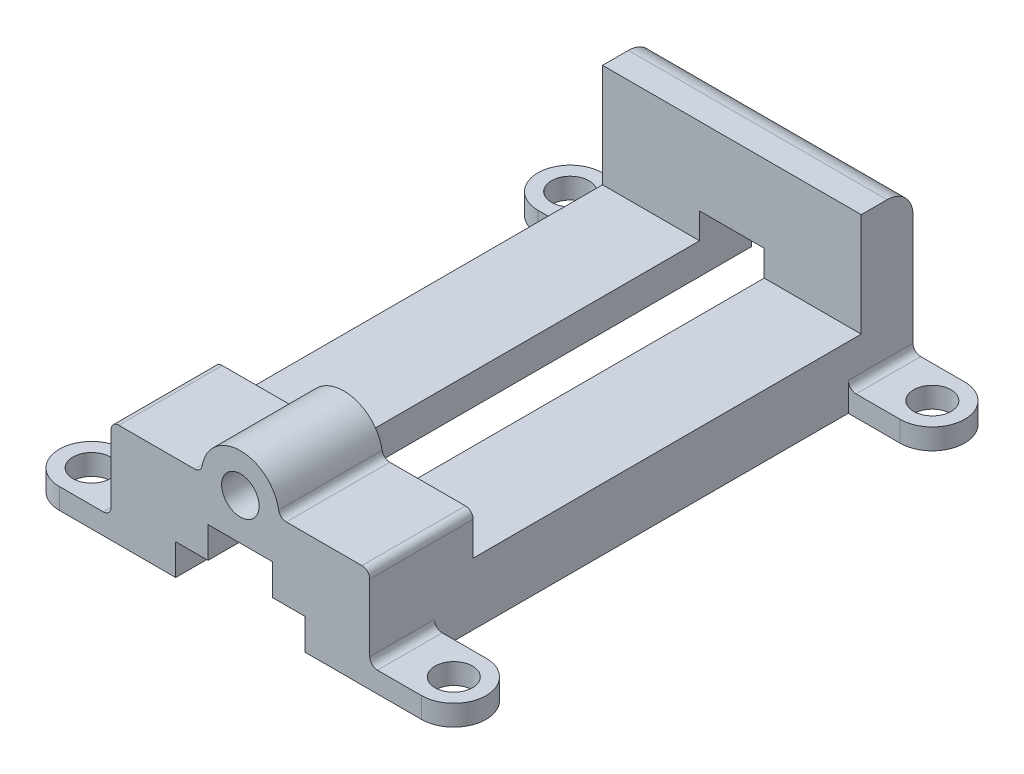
ISO-10303-21;
HEADER;
FILE_DESCRIPTION(('STEP AP214'),'2;1');
FILE_NAME('part.step','',(''),(''),'','','');
FILE_SCHEMA(('AUTOMOTIVE_DESIGN { 1 0 10303 214 1 1 1 1 }'));
ENDSEC;
DATA;
#1=APPLICATION_CONTEXT('core data for automotive mechanical design processes');
#2=APPLICATION_PROTOCOL_DEFINITION('international standard','automotive_design',2000,#1);
#3=PRODUCT_CONTEXT('',#1,'mechanical');
#4=PRODUCT('Part','Part','',(#3));
#5=PRODUCT_RELATED_PRODUCT_CATEGORY('part','',(#4));
#6=PRODUCT_DEFINITION_FORMATION('','',#4);
#7=PRODUCT_DEFINITION_CONTEXT('part definition',#1,'design');
#8=PRODUCT_DEFINITION('design','',#6,#7);
#9=PRODUCT_DEFINITION_SHAPE('','',#8);
#10=(LENGTH_UNIT() NAMED_UNIT(*) SI_UNIT(.MILLI.,.METRE.));
#11=(NAMED_UNIT(*) PLANE_ANGLE_UNIT() SI_UNIT($,.RADIAN.));
#12=(NAMED_UNIT(*) SI_UNIT($,.STERADIAN.) SOLID_ANGLE_UNIT());
#13=UNCERTAINTY_MEASURE_WITH_UNIT(LENGTH_MEASURE(1.E-05),#10,'distance_accuracy_value','');
#14=(GEOMETRIC_REPRESENTATION_CONTEXT(3) GLOBAL_UNCERTAINTY_ASSIGNED_CONTEXT((#13)) GLOBAL_UNIT_ASSIGNED_CONTEXT((#10,
#11,#12)) REPRESENTATION_CONTEXT('',''));
#15=CARTESIAN_POINT('',(0.,0.,0.));
#16=DIRECTION('',(0.,0.,1.));
#17=DIRECTION('',(1.,0.,0.));
#18=AXIS2_PLACEMENT_3D('',#15,#16,#17);
#19=CARTESIAN_POINT('',(70.,8.,-197.5));
#20=DIRECTION('',(0.,-1.,0.));
#21=DIRECTION('',(0.,0.,-1.));
#22=AXIS2_PLACEMENT_3D('',#19,#20,#21);
#23=PLANE('',#22);
#24=DIRECTION('',(-1.,0.,0.));
#25=VECTOR('',#24,1.);
#26=CARTESIAN_POINT('',(50.,8.,-210.));
#27=LINE('',#26,#25);
#28=CARTESIAN_POINT('',(70.,8.,-210.));
#29=VERTEX_POINT('',#28);
#30=CARTESIAN_POINT('',(53.,8.,-210.));
#31=VERTEX_POINT('',#30);
#32=EDGE_CURVE('E650',#29,#31,#27,.T.);
#33=ORIENTED_EDGE('',*,*,#32,.T.);
#34=DIRECTION('',(0.,0.,1.));
#35=VECTOR('',#34,1.);
#36=CARTESIAN_POINT('',(53.,8.,-197.5));
#37=LINE('',#36,#35);
#38=CARTESIAN_POINT('',(53.,8.,-185.));
#39=VERTEX_POINT('',#38);
#40=EDGE_CURVE('E428',#31,#39,#37,.T.);
#41=ORIENTED_EDGE('',*,*,#40,.T.);
#42=DIRECTION('',(1.,0.,0.));
#43=VECTOR('',#42,1.);
#44=CARTESIAN_POINT('',(70.,8.,-185.));
#45=LINE('',#44,#43);
#46=CARTESIAN_POINT('',(70.,8.,-185.));
#47=VERTEX_POINT('',#46);
#48=EDGE_CURVE('E646',#39,#47,#45,.T.);
#49=ORIENTED_EDGE('',*,*,#48,.T.);
#50=CARTESIAN_POINT('',(70.,8.,-197.5));
#51=DIRECTION('',(0.,1.,0.));
#52=DIRECTION('',(0.,0.,-1.));
#53=AXIS2_PLACEMENT_3D('',#50,#51,#52);
#54=CIRCLE('',#53,12.5);
#55=EDGE_CURVE('E653',#47,#29,#54,.T.);
#56=ORIENTED_EDGE('',*,*,#55,.T.);
#57=EDGE_LOOP('',(#33,#41,#49,#56));
#58=FACE_BOUND('',#57,.T.);
#59=CARTESIAN_POINT('',(70.,8.,-197.5));
#60=DIRECTION('',(0.,1.,0.));
#61=DIRECTION('',(0.,0.,1.));
#62=AXIS2_PLACEMENT_3D('',#59,#60,#61);
#63=CIRCLE('',#62,7.24999999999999);
#64=CARTESIAN_POINT('',(70.,8.,-190.25));
#65=VERTEX_POINT('',#64);
#66=EDGE_CURVE('E1279',#65,#65,#63,.T.);
#67=ORIENTED_EDGE('',*,*,#66,.F.);
#68=EDGE_LOOP('',(#67));
#69=FACE_BOUND('',#68,.T.);
#70=ADVANCED_FACE('F35',(#58,#69),#23,.F.);
#71=CARTESIAN_POINT('',(-70.,8.,-12.5));
#72=DIRECTION('',(0.,-1.,0.));
#73=DIRECTION('',(0.,0.,-1.));
#74=AXIS2_PLACEMENT_3D('',#71,#72,#73);
#75=PLANE('',#74);
#76=DIRECTION('',(1.,0.,0.));
#77=VECTOR('',#76,1.);
#78=CARTESIAN_POINT('',(-50.,8.,0.));
#79=LINE('',#78,#77);
#80=CARTESIAN_POINT('',(-70.,8.,0.));
#81=VERTEX_POINT('',#80);
#82=CARTESIAN_POINT('',(-53.,8.,0.));
#83=VERTEX_POINT('',#82);
#84=EDGE_CURVE('E349',#81,#83,#79,.T.);
#85=ORIENTED_EDGE('',*,*,#84,.T.);
#86=DIRECTION('',(0.,0.,-1.));
#87=VECTOR('',#86,1.);
#88=CARTESIAN_POINT('',(-53.,8.,-12.5));
#89=LINE('',#88,#87);
#90=CARTESIAN_POINT('',(-53.,8.,-25.));
#91=VERTEX_POINT('',#90);
#92=EDGE_CURVE('E393',#83,#91,#89,.T.);
#93=ORIENTED_EDGE('',*,*,#92,.T.);
#94=DIRECTION('',(-1.,0.,0.));
#95=VECTOR('',#94,1.);
#96=CARTESIAN_POINT('',(-70.,8.,-25.));
#97=LINE('',#96,#95);
#98=CARTESIAN_POINT('',(-70.,8.,-25.));
#99=VERTEX_POINT('',#98);
#100=EDGE_CURVE('E350',#91,#99,#97,.T.);
#101=ORIENTED_EDGE('',*,*,#100,.T.);
#102=CARTESIAN_POINT('',(-70.,8.,-12.5));
#103=DIRECTION('',(0.,1.,0.));
#104=DIRECTION('',(0.,0.,-1.));
#105=AXIS2_PLACEMENT_3D('',#102,#103,#104);
#106=CIRCLE('',#105,12.5);
#107=EDGE_CURVE('E346',#99,#81,#106,.T.);
#108=ORIENTED_EDGE('',*,*,#107,.T.);
#109=EDGE_LOOP('',(#85,#93,#101,#108));
#110=FACE_BOUND('',#109,.T.);
#111=CARTESIAN_POINT('',(-70.,8.,-12.5));
#112=DIRECTION('',(0.,1.,0.));
#113=DIRECTION('',(0.,0.,1.));
#114=AXIS2_PLACEMENT_3D('',#111,#112,#113);
#115=CIRCLE('',#114,7.24999999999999);
#116=CARTESIAN_POINT('',(-70.,8.,-5.25000000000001));
#117=VERTEX_POINT('',#116);
#118=EDGE_CURVE('E333',#117,#117,#115,.T.);
#119=ORIENTED_EDGE('',*,*,#118,.F.);
#120=EDGE_LOOP('',(#119));
#121=FACE_BOUND('',#120,.T.);
#122=ADVANCED_FACE('F391',(#110,#121),#75,.F.);
#123=CARTESIAN_POINT('',(-50.,0.,-210.));
#124=DIRECTION('',(-1.,0.,0.));
#125=DIRECTION('',(0.,0.,1.));
#126=AXIS2_PLACEMENT_3D('',#123,#124,#125);
#127=PLANE('',#126);
#128=DIRECTION('',(0.,-1.,0.));
#129=VECTOR('',#128,1.);
#130=CARTESIAN_POINT('',(-50.,0.,-210.));
#131=LINE('',#130,#129);
#132=CARTESIAN_POINT('',(-50.,54.,-210.));
#133=VERTEX_POINT('',#132);
#134=CARTESIAN_POINT('',(-50.,11.,-210.));
#135=VERTEX_POINT('',#134);
#136=EDGE_CURVE('E689',#133,#135,#131,.T.);
#137=ORIENTED_EDGE('',*,*,#136,.T.);
#138=DIRECTION('',(0.,0.,-1.));
#139=VECTOR('',#138,1.);
#140=CARTESIAN_POINT('',(-50.,11.,-185.));
#141=LINE('',#140,#139);
#142=CARTESIAN_POINT('',(-50.,11.,-185.));
#143=VERTEX_POINT('',#142);
#144=EDGE_CURVE('E407',#135,#143,#141,.F.);
#145=ORIENTED_EDGE('',*,*,#144,.T.);
#146=DIRECTION('',(0.,-1.,0.));
#147=VECTOR('',#146,1.);
#148=CARTESIAN_POINT('',(-50.,8.,-185.));
#149=LINE('',#148,#147);
#150=CARTESIAN_POINT('',(-50.,0.,-185.));
#151=VERTEX_POINT('',#150);
#152=EDGE_CURVE('E324',#143,#151,#149,.T.);
#153=ORIENTED_EDGE('',*,*,#152,.T.);
#154=DIRECTION('',(0.,0.,1.));
#155=VECTOR('',#154,1.);
#156=CARTESIAN_POINT('',(-50.,0.,-210.));
#157=LINE('',#156,#155);
#158=CARTESIAN_POINT('',(-50.,0.,-25.));
#159=VERTEX_POINT('',#158);
#160=EDGE_CURVE('E311',#151,#159,#157,.T.);
#161=ORIENTED_EDGE('',*,*,#160,.T.);
#162=DIRECTION('',(0.,-1.,0.));
#163=VECTOR('',#162,1.);
#164=CARTESIAN_POINT('',(-50.,8.,-25.));
#165=LINE('',#164,#163);
#166=CARTESIAN_POINT('',(-50.,11.,-25.));
#167=VERTEX_POINT('',#166);
#168=EDGE_CURVE('E355',#167,#159,#165,.T.);
#169=ORIENTED_EDGE('',*,*,#168,.F.);
#170=DIRECTION('',(0.,0.,-1.));
#171=VECTOR('',#170,1.);
#172=CARTESIAN_POINT('',(-50.,11.,-210.));
#173=LINE('',#172,#171);
#174=CARTESIAN_POINT('',(-50.,11.,0.));
#175=VERTEX_POINT('',#174);
#176=EDGE_CURVE('E412',#167,#175,#173,.F.);
#177=ORIENTED_EDGE('',*,*,#176,.T.);
#178=DIRECTION('',(0.,-1.,0.));
#179=VECTOR('',#178,1.);
#180=CARTESIAN_POINT('',(-50.,0.,0.));
#181=LINE('',#180,#179);
#182=CARTESIAN_POINT('',(-50.,37.,0.));
#183=VERTEX_POINT('',#182);
#184=EDGE_CURVE('E451',#183,#175,#181,.T.);
#185=ORIENTED_EDGE('',*,*,#184,.F.);
#186=DIRECTION('',(0.,0.,1.));
#187=VECTOR('',#186,1.);
#188=CARTESIAN_POINT('',(-50.,37.,-210.));
#189=LINE('',#188,#187);
#190=CARTESIAN_POINT('',(-50.,37.,-40.));
#191=VERTEX_POINT('',#190);
#192=EDGE_CURVE('E458',#183,#191,#189,.F.);
#193=ORIENTED_EDGE('',*,*,#192,.T.);
#194=DIRECTION('',(0.,-1.,0.));
#195=VECTOR('',#194,1.);
#196=CARTESIAN_POINT('',(-50.,24.,-40.));
#197=LINE('',#196,#195);
#198=CARTESIAN_POINT('',(-50.,24.,-40.));
#199=VERTEX_POINT('',#198);
#200=EDGE_CURVE('E574',#191,#199,#197,.T.);
#201=ORIENTED_EDGE('',*,*,#200,.T.);
#202=DIRECTION('',(0.,0.,-1.));
#203=VECTOR('',#202,1.);
#204=CARTESIAN_POINT('',(-50.,24.,-40.));
#205=LINE('',#204,#203);
#206=CARTESIAN_POINT('',(-50.,24.,-190.));
#207=VERTEX_POINT('',#206);
#208=EDGE_CURVE('E594',#199,#207,#205,.T.);
#209=ORIENTED_EDGE('',*,*,#208,.T.);
#210=DIRECTION('',(0.,1.,0.));
#211=VECTOR('',#210,1.);
#212=CARTESIAN_POINT('',(-50.,24.,-190.));
#213=LINE('',#212,#211);
#214=CARTESIAN_POINT('',(-50.,64.,-190.));
#215=VERTEX_POINT('',#214);
#216=EDGE_CURVE('E571',#207,#215,#213,.T.);
#217=ORIENTED_EDGE('',*,*,#216,.T.);
#218=DIRECTION('',(0.,0.,1.));
#219=VECTOR('',#218,1.);
#220=CARTESIAN_POINT('',(-50.,64.,-210.));
#221=LINE('',#220,#219);
#222=CARTESIAN_POINT('',(-50.,64.,-200.));
#223=VERTEX_POINT('',#222);
#224=EDGE_CURVE('E565',#223,#215,#221,.T.);
#225=ORIENTED_EDGE('',*,*,#224,.F.);
#226=CARTESIAN_POINT('',(-50.,54.,-200.));
#227=DIRECTION('',(-1.,0.,0.));
#228=DIRECTION('',(0.,0.,1.));
#229=AXIS2_PLACEMENT_3D('',#226,#227,#228);
#230=CIRCLE('',#229,10.);
#231=EDGE_CURVE('E702',#223,#133,#230,.T.);
#232=ORIENTED_EDGE('',*,*,#231,.T.);
#233=EDGE_LOOP('',(#137,#145,#153,#161,#169,#177,#185,#193,#201,#209,#217,#225,#232));
#234=FACE_BOUND('',#233,.T.);
#235=ADVANCED_FACE('F462',(#234),#127,.T.);
#236=CARTESIAN_POINT('',(50.,0.,-210.));
#237=DIRECTION('',(1.,0.,0.));
#238=DIRECTION('',(0.,0.,-1.));
#239=AXIS2_PLACEMENT_3D('',#236,#237,#238);
#240=PLANE('',#239);
#241=DIRECTION('',(0.,-1.,0.));
#242=VECTOR('',#241,1.);
#243=CARTESIAN_POINT('',(50.,8.,-185.));
#244=LINE('',#243,#242);
#245=CARTESIAN_POINT('',(50.,11.,-185.));
#246=VERTEX_POINT('',#245);
#247=CARTESIAN_POINT('',(50.,0.,-185.));
#248=VERTEX_POINT('',#247);
#249=EDGE_CURVE('E635',#246,#248,#244,.T.);
#250=ORIENTED_EDGE('',*,*,#249,.F.);
#251=DIRECTION('',(0.,0.,1.));
#252=VECTOR('',#251,1.);
#253=CARTESIAN_POINT('',(50.,11.,-210.));
#254=LINE('',#253,#252);
#255=CARTESIAN_POINT('',(50.,11.,-210.));
#256=VERTEX_POINT('',#255);
#257=EDGE_CURVE('E474',#246,#256,#254,.F.);
#258=ORIENTED_EDGE('',*,*,#257,.T.);
#259=DIRECTION('',(0.,1.,0.));
#260=VECTOR('',#259,1.);
#261=CARTESIAN_POINT('',(50.,0.,-210.));
#262=LINE('',#261,#260);
#263=CARTESIAN_POINT('',(50.,54.,-210.));
#264=VERTEX_POINT('',#263);
#265=EDGE_CURVE('E687',#256,#264,#262,.T.);
#266=ORIENTED_EDGE('',*,*,#265,.T.);
#267=CARTESIAN_POINT('',(50.,54.,-200.));
#268=DIRECTION('',(1.,0.,0.));
#269=DIRECTION('',(0.,0.,-1.));
#270=AXIS2_PLACEMENT_3D('',#267,#268,#269);
#271=CIRCLE('',#270,10.);
#272=CARTESIAN_POINT('',(50.,64.,-200.));
#273=VERTEX_POINT('',#272);
#274=EDGE_CURVE('E706',#264,#273,#271,.T.);
#275=ORIENTED_EDGE('',*,*,#274,.T.);
#276=DIRECTION('',(0.,0.,1.));
#277=VECTOR('',#276,1.);
#278=CARTESIAN_POINT('',(50.,64.,-210.));
#279=LINE('',#278,#277);
#280=CARTESIAN_POINT('',(50.,64.,-190.));
#281=VERTEX_POINT('',#280);
#282=EDGE_CURVE('E564',#273,#281,#279,.T.);
#283=ORIENTED_EDGE('',*,*,#282,.T.);
#284=DIRECTION('',(0.,1.,0.));
#285=VECTOR('',#284,1.);
#286=CARTESIAN_POINT('',(50.,24.,-190.));
#287=LINE('',#286,#285);
#288=CARTESIAN_POINT('',(50.,24.,-190.));
#289=VERTEX_POINT('',#288);
#290=EDGE_CURVE('E587',#289,#281,#287,.T.);
#291=ORIENTED_EDGE('',*,*,#290,.F.);
#292=DIRECTION('',(0.,0.,-1.));
#293=VECTOR('',#292,1.);
#294=CARTESIAN_POINT('',(50.,24.,-40.));
#295=LINE('',#294,#293);
#296=CARTESIAN_POINT('',(50.,24.,-40.));
#297=VERTEX_POINT('',#296);
#298=EDGE_CURVE('E584',#297,#289,#295,.T.);
#299=ORIENTED_EDGE('',*,*,#298,.F.);
#300=DIRECTION('',(0.,-1.,0.));
#301=VECTOR('',#300,1.);
#302=CARTESIAN_POINT('',(50.,24.,-40.));
#303=LINE('',#302,#301);
#304=CARTESIAN_POINT('',(50.,37.,-40.));
#305=VERTEX_POINT('',#304);
#306=EDGE_CURVE('E582',#305,#297,#303,.T.);
#307=ORIENTED_EDGE('',*,*,#306,.F.);
#308=DIRECTION('',(0.,0.,1.));
#309=VECTOR('',#308,1.);
#310=CARTESIAN_POINT('',(50.,37.,-210.));
#311=LINE('',#310,#309);
#312=CARTESIAN_POINT('',(50.,37.,0.));
#313=VERTEX_POINT('',#312);
#314=EDGE_CURVE('E431',#305,#313,#311,.T.);
#315=ORIENTED_EDGE('',*,*,#314,.T.);
#316=DIRECTION('',(0.,1.,0.));
#317=VECTOR('',#316,1.);
#318=CARTESIAN_POINT('',(50.,0.,0.));
#319=LINE('',#318,#317);
#320=CARTESIAN_POINT('',(50.,11.,0.));
#321=VERTEX_POINT('',#320);
#322=EDGE_CURVE('E432',#321,#313,#319,.T.);
#323=ORIENTED_EDGE('',*,*,#322,.F.);
#324=DIRECTION('',(0.,0.,1.));
#325=VECTOR('',#324,1.);
#326=CARTESIAN_POINT('',(50.,11.,-25.));
#327=LINE('',#326,#325);
#328=CARTESIAN_POINT('',(50.,11.,-25.));
#329=VERTEX_POINT('',#328);
#330=EDGE_CURVE('E508',#321,#329,#327,.F.);
#331=ORIENTED_EDGE('',*,*,#330,.T.);
#332=DIRECTION('',(0.,-1.,0.));
#333=VECTOR('',#332,1.);
#334=CARTESIAN_POINT('',(50.,8.,-25.));
#335=LINE('',#334,#333);
#336=CARTESIAN_POINT('',(50.,0.,-25.));
#337=VERTEX_POINT('',#336);
#338=EDGE_CURVE('E526',#329,#337,#335,.T.);
#339=ORIENTED_EDGE('',*,*,#338,.T.);
#340=DIRECTION('',(0.,0.,1.));
#341=VECTOR('',#340,1.);
#342=CARTESIAN_POINT('',(50.,0.,-210.));
#343=LINE('',#342,#341);
#344=EDGE_CURVE('E372',#248,#337,#343,.T.);
#345=ORIENTED_EDGE('',*,*,#344,.F.);
#346=EDGE_LOOP('',(#250,#258,#266,#275,#283,#291,#299,#307,#315,#323,#331,#339,#345));
#347=FACE_BOUND('',#346,.T.);
#348=ADVANCED_FACE('F506',(#347),#240,.T.);
#349=CARTESIAN_POINT('',(-50.,40.,-210.));
#350=DIRECTION('',(0.,1.,0.));
#351=DIRECTION('',(0.,0.,1.));
#352=AXIS2_PLACEMENT_3D('',#349,#350,#351);
#353=PLANE('',#352);
#354=DIRECTION('',(-1.,0.,0.));
#355=VECTOR('',#354,1.);
#356=CARTESIAN_POINT('',(-50.,40.,0.));
#357=LINE('',#356,#355);
#358=CARTESIAN_POINT('',(-17.7482393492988,40.,0.));
#359=VERTEX_POINT('',#358);
#360=CARTESIAN_POINT('',(-47.,40.,0.));
#361=VERTEX_POINT('',#360);
#362=EDGE_CURVE('E448',#359,#361,#357,.T.);
#363=ORIENTED_EDGE('',*,*,#362,.F.);
#364=DIRECTION('',(0.,0.,-1.));
#365=VECTOR('',#364,1.);
#366=CARTESIAN_POINT('',(-17.7482393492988,40.,-40.));
#367=LINE('',#366,#365);
#368=CARTESIAN_POINT('',(-17.7482393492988,40.,-40.));
#369=VERTEX_POINT('',#368);
#370=EDGE_CURVE('E421',#359,#369,#367,.T.);
#371=ORIENTED_EDGE('',*,*,#370,.T.);
#372=DIRECTION('',(-1.,0.,0.));
#373=VECTOR('',#372,1.);
#374=CARTESIAN_POINT('',(-50.001,40.,-40.));
#375=LINE('',#374,#373);
#376=CARTESIAN_POINT('',(-47.,40.,-40.));
#377=VERTEX_POINT('',#376);
#378=EDGE_CURVE('E579',#369,#377,#375,.T.);
#379=ORIENTED_EDGE('',*,*,#378,.T.);
#380=DIRECTION('',(0.,0.,1.));
#381=VECTOR('',#380,1.);
#382=CARTESIAN_POINT('',(-47.,40.,-210.));
#383=LINE('',#382,#381);
#384=EDGE_CURVE('E418',#377,#361,#383,.T.);
#385=ORIENTED_EDGE('',*,*,#384,.T.);
#386=EDGE_LOOP('',(#363,#371,#379,#385));
#387=FACE_BOUND('',#386,.T.);
#388=ADVANCED_FACE('F800',(#387),#353,.T.);
#389=CARTESIAN_POINT('',(0.,40.,-210.));
#390=DIRECTION('',(0.,0.,1.));
#391=DIRECTION('',(1.,0.,0.));
#392=AXIS2_PLACEMENT_3D('',#389,#390,#391);
#393=CYLINDRICAL_SURFACE('',#392,15.);
#394=CARTESIAN_POINT('',(0.,40.,-40.));
#395=DIRECTION('',(0.,0.,1.));
#396=DIRECTION('',(0.,-1.,0.));
#397=AXIS2_PLACEMENT_3D('',#394,#395,#396);
#398=CIRCLE('',#397,15.);
#399=CARTESIAN_POINT('',(14.790199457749,42.5,-40.));
#400=VERTEX_POINT('',#399);
#401=CARTESIAN_POINT('',(-14.790199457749,42.5,-40.));
#402=VERTEX_POINT('',#401);
#403=EDGE_CURVE('E576',#400,#402,#398,.T.);
#404=ORIENTED_EDGE('',*,*,#403,.T.);
#405=DIRECTION('',(0.,0.,1.));
#406=VECTOR('',#405,1.);
#407=CARTESIAN_POINT('',(-14.790199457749,42.5,-210.));
#408=LINE('',#407,#406);
#409=CARTESIAN_POINT('',(-14.790199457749,42.5,0.));
#410=VERTEX_POINT('',#409);
#411=EDGE_CURVE('E409',#402,#410,#408,.T.);
#412=ORIENTED_EDGE('',*,*,#411,.T.);
#413=CARTESIAN_POINT('',(0.,40.,0.));
#414=DIRECTION('',(0.,0.,1.));
#415=DIRECTION('',(-1.,0.,0.));
#416=AXIS2_PLACEMENT_3D('',#413,#414,#415);
#417=CIRCLE('',#416,15.);
#418=CARTESIAN_POINT('',(14.790199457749,42.5,0.));
#419=VERTEX_POINT('',#418);
#420=EDGE_CURVE('E445',#419,#410,#417,.T.);
#421=ORIENTED_EDGE('',*,*,#420,.F.);
#422=DIRECTION('',(0.,0.,1.));
#423=VECTOR('',#422,1.);
#424=CARTESIAN_POINT('',(14.790199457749,42.5,-210.));
#425=LINE('',#424,#423);
#426=EDGE_CURVE('E406',#419,#400,#425,.F.);
#427=ORIENTED_EDGE('',*,*,#426,.T.);
#428=EDGE_LOOP('',(#404,#412,#421,#427));
#429=FACE_BOUND('',#428,.T.);
#430=ADVANCED_FACE('F803',(#429),#393,.T.);
#431=CARTESIAN_POINT('',(50.,40.,-210.));
#432=DIRECTION('',(0.,1.,0.));
#433=DIRECTION('',(0.,0.,1.));
#434=AXIS2_PLACEMENT_3D('',#431,#432,#433);
#435=PLANE('',#434);
#436=DIRECTION('',(-1.,0.,0.));
#437=VECTOR('',#436,1.);
#438=CARTESIAN_POINT('',(-50.001,40.,-40.));
#439=LINE('',#438,#437);
#440=CARTESIAN_POINT('',(47.,40.,-40.));
#441=VERTEX_POINT('',#440);
#442=CARTESIAN_POINT('',(17.7482393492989,40.,-40.));
#443=VERTEX_POINT('',#442);
#444=EDGE_CURVE('E567',#441,#443,#439,.T.);
#445=ORIENTED_EDGE('',*,*,#444,.T.);
#446=DIRECTION('',(0.,0.,-1.));
#447=VECTOR('',#446,1.);
#448=CARTESIAN_POINT('',(17.7482393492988,40.,0.));
#449=LINE('',#448,#447);
#450=CARTESIAN_POINT('',(17.7482393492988,40.,0.));
#451=VERTEX_POINT('',#450);
#452=EDGE_CURVE('E425',#443,#451,#449,.F.);
#453=ORIENTED_EDGE('',*,*,#452,.T.);
#454=DIRECTION('',(-1.,0.,0.));
#455=VECTOR('',#454,1.);
#456=CARTESIAN_POINT('',(50.,40.,0.));
#457=LINE('',#456,#455);
#458=CARTESIAN_POINT('',(47.,40.,0.));
#459=VERTEX_POINT('',#458);
#460=EDGE_CURVE('E436',#459,#451,#457,.T.);
#461=ORIENTED_EDGE('',*,*,#460,.F.);
#462=DIRECTION('',(0.,0.,1.));
#463=VECTOR('',#462,1.);
#464=CARTESIAN_POINT('',(47.,40.,-210.));
#465=LINE('',#464,#463);
#466=EDGE_CURVE('E423',#459,#441,#465,.F.);
#467=ORIENTED_EDGE('',*,*,#466,.T.);
#468=EDGE_LOOP('',(#445,#453,#461,#467));
#469=FACE_BOUND('',#468,.T.);
#470=ADVANCED_FACE('F732',(#469),#435,.T.);
#471=CARTESIAN_POINT('',(-12.5,24.,-210.));
#472=DIRECTION('',(0.,-1.,0.));
#473=DIRECTION('',(0.,0.,-1.));
#474=AXIS2_PLACEMENT_3D('',#471,#472,#473);
#475=PLANE('',#474);
#476=DIRECTION('',(1.,0.,0.));
#477=VECTOR('',#476,1.);
#478=CARTESIAN_POINT('',(-50.001,24.,-40.));
#479=LINE('',#478,#477);
#480=CARTESIAN_POINT('',(-12.5,24.,-40.));
#481=VERTEX_POINT('',#480);
#482=CARTESIAN_POINT('',(12.5,24.,-40.));
#483=VERTEX_POINT('',#482);
#484=EDGE_CURVE('E598',#481,#483,#479,.T.);
#485=ORIENTED_EDGE('',*,*,#484,.T.);
#486=DIRECTION('',(0.,0.,1.));
#487=VECTOR('',#486,1.);
#488=CARTESIAN_POINT('',(12.5,24.,-210.));
#489=LINE('',#488,#487);
#490=CARTESIAN_POINT('',(12.5,24.,0.));
#491=VERTEX_POINT('',#490);
#492=EDGE_CURVE('E1243',#483,#491,#489,.T.);
#493=ORIENTED_EDGE('',*,*,#492,.T.);
#494=DIRECTION('',(1.,0.,0.));
#495=VECTOR('',#494,1.);
#496=CARTESIAN_POINT('',(-12.5,24.,0.));
#497=LINE('',#496,#495);
#498=CARTESIAN_POINT('',(-12.5,24.,0.));
#499=VERTEX_POINT('',#498);
#500=EDGE_CURVE('E612',#499,#491,#497,.T.);
#501=ORIENTED_EDGE('',*,*,#500,.F.);
#502=DIRECTION('',(0.,0.,1.));
#503=VECTOR('',#502,1.);
#504=CARTESIAN_POINT('',(-12.5,24.,-210.));
#505=LINE('',#504,#503);
#506=EDGE_CURVE('E695',#481,#499,#505,.T.);
#507=ORIENTED_EDGE('',*,*,#506,.F.);
#508=EDGE_LOOP('',(#485,#493,#501,#507));
#509=FACE_BOUND('',#508,.T.);
#510=ADVANCED_FACE('F725',(#509),#475,.T.);
#511=CARTESIAN_POINT('',(-25.,0.,-210.));
#512=DIRECTION('',(1.,0.,0.));
#513=DIRECTION('',(0.,0.,-1.));
#514=AXIS2_PLACEMENT_3D('',#511,#512,#513);
#515=PLANE('',#514);
#516=DIRECTION('',(0.,1.,0.));
#517=VECTOR('',#516,1.);
#518=CARTESIAN_POINT('',(-25.,0.,0.));
#519=LINE('',#518,#517);
#520=CARTESIAN_POINT('',(-25.,0.,0.));
#521=VERTEX_POINT('',#520);
#522=CARTESIAN_POINT('',(-25.,12.,0.));
#523=VERTEX_POINT('',#522);
#524=EDGE_CURVE('E603',#521,#523,#519,.T.);
#525=ORIENTED_EDGE('',*,*,#524,.F.);
#526=DIRECTION('',(0.,0.,1.));
#527=VECTOR('',#526,1.);
#528=CARTESIAN_POINT('',(-25.,0.,-210.));
#529=LINE('',#528,#527);
#530=CARTESIAN_POINT('',(-25.,0.,-210.));
#531=VERTEX_POINT('',#530);
#532=EDGE_CURVE('E371',#531,#521,#529,.T.);
#533=ORIENTED_EDGE('',*,*,#532,.F.);
#534=DIRECTION('',(0.,1.,0.));
#535=VECTOR('',#534,1.);
#536=CARTESIAN_POINT('',(-25.,0.,-210.));
#537=LINE('',#536,#535);
#538=CARTESIAN_POINT('',(-25.,12.,-210.));
#539=VERTEX_POINT('',#538);
#540=EDGE_CURVE('E666',#531,#539,#537,.T.);
#541=ORIENTED_EDGE('',*,*,#540,.T.);
#542=DIRECTION('',(0.,0.,1.));
#543=VECTOR('',#542,1.);
#544=CARTESIAN_POINT('',(-25.,12.,-210.));
#545=LINE('',#544,#543);
#546=EDGE_CURVE('E691',#539,#523,#545,.T.);
#547=ORIENTED_EDGE('',*,*,#546,.T.);
#548=EDGE_LOOP('',(#525,#533,#541,#547));
#549=FACE_BOUND('',#548,.T.);
#550=ADVANCED_FACE('F37',(#549),#515,.T.);
#551=CARTESIAN_POINT('',(-25.,0.,-210.));
#552=DIRECTION('',(0.,-1.,0.));
#553=DIRECTION('',(1.,0.,0.));
#554=AXIS2_PLACEMENT_3D('',#551,#552,#553);
#555=PLANE('',#554);
#556=CARTESIAN_POINT('',(-70.,0.,-197.5));
#557=DIRECTION('',(0.,-1.,0.));
#558=DIRECTION('',(1.,0.,0.));
#559=AXIS2_PLACEMENT_3D('',#556,#557,#558);
#560=CIRCLE('',#559,7.24999999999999);
#561=CARTESIAN_POINT('',(-62.75,0.,-197.5));
#562=VERTEX_POINT('',#561);
#563=EDGE_CURVE('E1291',#562,#562,#560,.T.);
#564=ORIENTED_EDGE('',*,*,#563,.F.);
#565=EDGE_LOOP('',(#564));
#566=FACE_BOUND('',#565,.T.);
#567=CARTESIAN_POINT('',(-70.,0.,-12.5));
#568=DIRECTION('',(0.,-1.,0.));
#569=DIRECTION('',(1.,0.,0.));
#570=AXIS2_PLACEMENT_3D('',#567,#568,#569);
#571=CIRCLE('',#570,7.24999999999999);
#572=CARTESIAN_POINT('',(-62.75,0.,-12.5));
#573=VERTEX_POINT('',#572);
#574=EDGE_CURVE('E330',#573,#573,#571,.T.);
#575=ORIENTED_EDGE('',*,*,#574,.F.);
#576=EDGE_LOOP('',(#575));
#577=FACE_BOUND('',#576,.T.);
#578=DIRECTION('',(1.,0.,0.));
#579=VECTOR('',#578,1.);
#580=CARTESIAN_POINT('',(-25.,0.,0.));
#581=LINE('',#580,#579);
#582=CARTESIAN_POINT('',(-70.,0.,0.));
#583=VERTEX_POINT('',#582);
#584=EDGE_CURVE('E454',#583,#521,#581,.T.);
#585=ORIENTED_EDGE('',*,*,#584,.F.);
#586=CARTESIAN_POINT('',(-70.,0.,-12.5));
#587=DIRECTION('',(0.,1.,0.));
#588=DIRECTION('',(0.,0.,-1.));
#589=AXIS2_PLACEMENT_3D('',#586,#587,#588);
#590=CIRCLE('',#589,12.5);
#591=CARTESIAN_POINT('',(-70.,0.,-25.));
#592=VERTEX_POINT('',#591);
#593=EDGE_CURVE('E323',#592,#583,#590,.T.);
#594=ORIENTED_EDGE('',*,*,#593,.F.);
#595=DIRECTION('',(-1.,0.,0.));
#596=VECTOR('',#595,1.);
#597=CARTESIAN_POINT('',(-70.,0.,-25.));
#598=LINE('',#597,#596);
#599=EDGE_CURVE('E345',#159,#592,#598,.T.);
#600=ORIENTED_EDGE('',*,*,#599,.F.);
#601=ORIENTED_EDGE('',*,*,#160,.F.);
#602=DIRECTION('',(1.,0.,0.));
#603=VECTOR('',#602,1.);
#604=CARTESIAN_POINT('',(-70.,0.,-185.));
#605=LINE('',#604,#603);
#606=CARTESIAN_POINT('',(-70.,0.,-185.));
#607=VERTEX_POINT('',#606);
#608=EDGE_CURVE('E304',#607,#151,#605,.T.);
#609=ORIENTED_EDGE('',*,*,#608,.F.);
#610=CARTESIAN_POINT('',(-70.,0.,-197.5));
#611=DIRECTION('',(0.,1.,0.));
#612=DIRECTION('',(0.,0.,1.));
#613=AXIS2_PLACEMENT_3D('',#610,#611,#612);
#614=CIRCLE('',#613,12.5);
#615=CARTESIAN_POINT('',(-70.,0.,-210.));
#616=VERTEX_POINT('',#615);
#617=EDGE_CURVE('E309',#616,#607,#614,.T.);
#618=ORIENTED_EDGE('',*,*,#617,.F.);
#619=DIRECTION('',(1.,0.,0.));
#620=VECTOR('',#619,1.);
#621=CARTESIAN_POINT('',(-25.,0.,-210.));
#622=LINE('',#621,#620);
#623=EDGE_CURVE('E690',#616,#531,#622,.T.);
#624=ORIENTED_EDGE('',*,*,#623,.T.);
#625=ORIENTED_EDGE('',*,*,#532,.T.);
#626=EDGE_LOOP('',(#585,#594,#600,#601,#609,#618,#624,#625));
#627=FACE_BOUND('',#626,.T.);
#628=ADVANCED_FACE('F306',(#566,#577,#627),#555,.T.);
#629=CARTESIAN_POINT('',(25.,0.,-210.));
#630=DIRECTION('',(0.,-1.,0.));
#631=DIRECTION('',(1.,0.,0.));
#632=AXIS2_PLACEMENT_3D('',#629,#630,#631);
#633=PLANE('',#632);
#634=CARTESIAN_POINT('',(70.,0.,-12.5));
#635=DIRECTION('',(0.,-1.,0.));
#636=DIRECTION('',(1.,0.,0.));
#637=AXIS2_PLACEMENT_3D('',#634,#635,#636);
#638=CIRCLE('',#637,7.24999999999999);
#639=CARTESIAN_POINT('',(77.25,0.,-12.5));
#640=VERTEX_POINT('',#639);
#641=EDGE_CURVE('E1278',#640,#640,#638,.T.);
#642=ORIENTED_EDGE('',*,*,#641,.F.);
#643=EDGE_LOOP('',(#642));
#644=FACE_BOUND('',#643,.T.);
#645=CARTESIAN_POINT('',(70.,0.,-197.5));
#646=DIRECTION('',(0.,-1.,0.));
#647=DIRECTION('',(1.,0.,0.));
#648=AXIS2_PLACEMENT_3D('',#645,#646,#647);
#649=CIRCLE('',#648,7.24999999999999);
#650=CARTESIAN_POINT('',(77.25,0.,-197.5));
#651=VERTEX_POINT('',#650);
#652=EDGE_CURVE('E1282',#651,#651,#649,.T.);
#653=ORIENTED_EDGE('',*,*,#652,.F.);
#654=EDGE_LOOP('',(#653));
#655=FACE_BOUND('',#654,.T.);
#656=DIRECTION('',(1.,0.,0.));
#657=VECTOR('',#656,1.);
#658=CARTESIAN_POINT('',(25.,0.,0.));
#659=LINE('',#658,#657);
#660=CARTESIAN_POINT('',(25.,0.,0.));
#661=VERTEX_POINT('',#660);
#662=CARTESIAN_POINT('',(70.,0.,0.));
#663=VERTEX_POINT('',#662);
#664=EDGE_CURVE('E437',#661,#663,#659,.T.);
#665=ORIENTED_EDGE('',*,*,#664,.F.);
#666=DIRECTION('',(0.,0.,1.));
#667=VECTOR('',#666,1.);
#668=CARTESIAN_POINT('',(25.,0.,-210.));
#669=LINE('',#668,#667);
#670=CARTESIAN_POINT('',(25.,0.,-210.));
#671=VERTEX_POINT('',#670);
#672=EDGE_CURVE('E381',#671,#661,#669,.T.);
#673=ORIENTED_EDGE('',*,*,#672,.F.);
#674=DIRECTION('',(1.,0.,0.));
#675=VECTOR('',#674,1.);
#676=CARTESIAN_POINT('',(25.,0.,-210.));
#677=LINE('',#676,#675);
#678=CARTESIAN_POINT('',(70.,0.,-210.));
#679=VERTEX_POINT('',#678);
#680=EDGE_CURVE('E685',#671,#679,#677,.T.);
#681=ORIENTED_EDGE('',*,*,#680,.T.);
#682=CARTESIAN_POINT('',(70.,0.,-197.5));
#683=DIRECTION('',(0.,1.,0.));
#684=DIRECTION('',(0.,0.,-1.));
#685=AXIS2_PLACEMENT_3D('',#682,#683,#684);
#686=CIRCLE('',#685,12.5);
#687=CARTESIAN_POINT('',(70.,0.,-185.));
#688=VERTEX_POINT('',#687);
#689=EDGE_CURVE('E656',#688,#679,#686,.T.);
#690=ORIENTED_EDGE('',*,*,#689,.F.);
#691=DIRECTION('',(1.,0.,0.));
#692=VECTOR('',#691,1.);
#693=CARTESIAN_POINT('',(70.,0.,-185.));
#694=LINE('',#693,#692);
#695=EDGE_CURVE('E633',#248,#688,#694,.T.);
#696=ORIENTED_EDGE('',*,*,#695,.F.);
#697=ORIENTED_EDGE('',*,*,#344,.T.);
#698=DIRECTION('',(-1.,0.,0.));
#699=VECTOR('',#698,1.);
#700=CARTESIAN_POINT('',(70.,0.,-25.));
#701=LINE('',#700,#699);
#702=CARTESIAN_POINT('',(70.,0.,-25.));
#703=VERTEX_POINT('',#702);
#704=EDGE_CURVE('E514',#703,#337,#701,.T.);
#705=ORIENTED_EDGE('',*,*,#704,.F.);
#706=CARTESIAN_POINT('',(70.,0.,-12.5));
#707=DIRECTION('',(0.,1.,0.));
#708=DIRECTION('',(0.,0.,1.));
#709=AXIS2_PLACEMENT_3D('',#706,#707,#708);
#710=CIRCLE('',#709,12.5);
#711=EDGE_CURVE('E519',#663,#703,#710,.T.);
#712=ORIENTED_EDGE('',*,*,#711,.F.);
#713=EDGE_LOOP('',(#665,#673,#681,#690,#696,#697,#705,#712));
#714=FACE_BOUND('',#713,.T.);
#715=ADVANCED_FACE('F630',(#644,#655,#714),#633,.T.);
#716=CARTESIAN_POINT('',(25.,0.,-210.));
#717=DIRECTION('',(-1.,0.,0.));
#718=DIRECTION('',(0.,0.,1.));
#719=AXIS2_PLACEMENT_3D('',#716,#717,#718);
#720=PLANE('',#719);
#721=DIRECTION('',(0.,-1.,0.));
#722=VECTOR('',#721,1.);
#723=CARTESIAN_POINT('',(25.,0.,0.));
#724=LINE('',#723,#722);
#725=CARTESIAN_POINT('',(25.,12.,0.));
#726=VERTEX_POINT('',#725);
#727=EDGE_CURVE('E620',#726,#661,#724,.T.);
#728=ORIENTED_EDGE('',*,*,#727,.F.);
#729=DIRECTION('',(0.,0.,1.));
#730=VECTOR('',#729,1.);
#731=CARTESIAN_POINT('',(25.,12.,-210.));
#732=LINE('',#731,#730);
#733=CARTESIAN_POINT('',(25.,12.,-210.));
#734=VERTEX_POINT('',#733);
#735=EDGE_CURVE('E1249',#734,#726,#732,.T.);
#736=ORIENTED_EDGE('',*,*,#735,.F.);
#737=DIRECTION('',(0.,-1.,0.));
#738=VECTOR('',#737,1.);
#739=CARTESIAN_POINT('',(25.,0.,-210.));
#740=LINE('',#739,#738);
#741=EDGE_CURVE('E682',#734,#671,#740,.T.);
#742=ORIENTED_EDGE('',*,*,#741,.T.);
#743=ORIENTED_EDGE('',*,*,#672,.T.);
#744=EDGE_LOOP('',(#728,#736,#742,#743));
#745=FACE_BOUND('',#744,.T.);
#746=ADVANCED_FACE('F815',(#745),#720,.T.);
#747=CARTESIAN_POINT('',(25.,12.,-210.));
#748=DIRECTION('',(0.,-1.,0.));
#749=DIRECTION('',(0.,0.,-1.));
#750=AXIS2_PLACEMENT_3D('',#747,#748,#749);
#751=PLANE('',#750);
#752=DIRECTION('',(1.,0.,0.));
#753=VECTOR('',#752,1.);
#754=CARTESIAN_POINT('',(25.,12.,0.));
#755=LINE('',#754,#753);
#756=CARTESIAN_POINT('',(12.5,12.,0.));
#757=VERTEX_POINT('',#756);
#758=EDGE_CURVE('E618',#757,#726,#755,.T.);
#759=ORIENTED_EDGE('',*,*,#758,.F.);
#760=DIRECTION('',(0.,0.,1.));
#761=VECTOR('',#760,1.);
#762=CARTESIAN_POINT('',(12.5,12.,-210.));
#763=LINE('',#762,#761);
#764=CARTESIAN_POINT('',(12.5,12.,-210.));
#765=VERTEX_POINT('',#764);
#766=EDGE_CURVE('E1246',#765,#757,#763,.T.);
#767=ORIENTED_EDGE('',*,*,#766,.F.);
#768=DIRECTION('',(1.,0.,0.));
#769=VECTOR('',#768,1.);
#770=CARTESIAN_POINT('',(25.,12.,-210.));
#771=LINE('',#770,#769);
#772=EDGE_CURVE('E679',#765,#734,#771,.T.);
#773=ORIENTED_EDGE('',*,*,#772,.T.);
#774=ORIENTED_EDGE('',*,*,#735,.T.);
#775=EDGE_LOOP('',(#759,#767,#773,#774));
#776=FACE_BOUND('',#775,.T.);
#777=ADVANCED_FACE('F819',(#776),#751,.T.);
#778=CARTESIAN_POINT('',(12.5,12.,-210.));
#779=DIRECTION('',(-1.,0.,0.));
#780=DIRECTION('',(0.,0.,1.));
#781=AXIS2_PLACEMENT_3D('',#778,#779,#780);
#782=PLANE('',#781);
#783=DIRECTION('',(0.,-1.,0.));
#784=VECTOR('',#783,1.);
#785=CARTESIAN_POINT('',(12.5,12.,0.));
#786=LINE('',#785,#784);
#787=EDGE_CURVE('E615',#491,#757,#786,.T.);
#788=ORIENTED_EDGE('',*,*,#787,.F.);
#789=ORIENTED_EDGE('',*,*,#492,.F.);
#790=DIRECTION('',(0.,0.,1.));
#791=VECTOR('',#790,1.);
#792=CARTESIAN_POINT('',(12.5,24.,-210.));
#793=LINE('',#792,#791);
#794=CARTESIAN_POINT('',(12.5,24.,-190.));
#795=VERTEX_POINT('',#794);
#796=EDGE_CURVE('E601',#795,#483,#793,.T.);
#797=ORIENTED_EDGE('',*,*,#796,.F.);
#798=DIRECTION('',(0.,1.,0.));
#799=VECTOR('',#798,1.);
#800=CARTESIAN_POINT('',(12.5,24.,-190.));
#801=LINE('',#800,#799);
#802=CARTESIAN_POINT('',(12.5,34.,-190.));
#803=VERTEX_POINT('',#802);
#804=EDGE_CURVE('E551',#795,#803,#801,.T.);
#805=ORIENTED_EDGE('',*,*,#804,.T.);
#806=DIRECTION('',(0.,0.,1.));
#807=VECTOR('',#806,1.);
#808=CARTESIAN_POINT('',(12.5,34.,-210.001));
#809=LINE('',#808,#807);
#810=CARTESIAN_POINT('',(12.5,34.,-210.));
#811=VERTEX_POINT('',#810);
#812=EDGE_CURVE('E557',#811,#803,#809,.T.);
#813=ORIENTED_EDGE('',*,*,#812,.F.);
#814=DIRECTION('',(0.,-1.,0.));
#815=VECTOR('',#814,1.);
#816=CARTESIAN_POINT('',(12.5,12.,-210.));
#817=LINE('',#816,#815);
#818=EDGE_CURVE('E676',#811,#765,#817,.T.);
#819=ORIENTED_EDGE('',*,*,#818,.T.);
#820=ORIENTED_EDGE('',*,*,#766,.T.);
#821=EDGE_LOOP('',(#788,#789,#797,#805,#813,#819,#820));
#822=FACE_BOUND('',#821,.T.);
#823=ADVANCED_FACE('F823',(#822),#782,.T.);
#824=CARTESIAN_POINT('',(-12.5,12.,-210.));
#825=DIRECTION('',(1.,0.,0.));
#826=DIRECTION('',(0.,0.,-1.));
#827=AXIS2_PLACEMENT_3D('',#824,#825,#826);
#828=PLANE('',#827);
#829=DIRECTION('',(0.,1.,0.));
#830=VECTOR('',#829,1.);
#831=CARTESIAN_POINT('',(-12.5,12.,0.));
#832=LINE('',#831,#830);
#833=CARTESIAN_POINT('',(-12.5,12.,0.));
#834=VERTEX_POINT('',#833);
#835=EDGE_CURVE('E609',#834,#499,#832,.T.);
#836=ORIENTED_EDGE('',*,*,#835,.F.);
#837=DIRECTION('',(0.,0.,1.));
#838=VECTOR('',#837,1.);
#839=CARTESIAN_POINT('',(-12.5,12.,-210.));
#840=LINE('',#839,#838);
#841=CARTESIAN_POINT('',(-12.5,12.,-210.));
#842=VERTEX_POINT('',#841);
#843=EDGE_CURVE('E692',#842,#834,#840,.T.);
#844=ORIENTED_EDGE('',*,*,#843,.F.);
#845=DIRECTION('',(0.,1.,0.));
#846=VECTOR('',#845,1.);
#847=CARTESIAN_POINT('',(-12.5,12.,-210.));
#848=LINE('',#847,#846);
#849=CARTESIAN_POINT('',(-12.5,34.,-210.));
#850=VERTEX_POINT('',#849);
#851=EDGE_CURVE('E672',#842,#850,#848,.T.);
#852=ORIENTED_EDGE('',*,*,#851,.T.);
#853=DIRECTION('',(0.,0.,1.));
#854=VECTOR('',#853,1.);
#855=CARTESIAN_POINT('',(-12.5,34.,-210.001));
#856=LINE('',#855,#854);
#857=CARTESIAN_POINT('',(-12.5,34.,-190.));
#858=VERTEX_POINT('',#857);
#859=EDGE_CURVE('E558',#850,#858,#856,.T.);
#860=ORIENTED_EDGE('',*,*,#859,.T.);
#861=DIRECTION('',(0.,-1.,0.));
#862=VECTOR('',#861,1.);
#863=CARTESIAN_POINT('',(-12.5,24.,-190.));
#864=LINE('',#863,#862);
#865=CARTESIAN_POINT('',(-12.5,24.,-190.));
#866=VERTEX_POINT('',#865);
#867=EDGE_CURVE('E549',#858,#866,#864,.T.);
#868=ORIENTED_EDGE('',*,*,#867,.T.);
#869=EDGE_CURVE('E1247',#866,#481,#505,.T.);
#870=ORIENTED_EDGE('',*,*,#869,.T.);
#871=ORIENTED_EDGE('',*,*,#506,.T.);
#872=EDGE_LOOP('',(#836,#844,#852,#860,#868,#870,#871));
#873=FACE_BOUND('',#872,.T.);
#874=ADVANCED_FACE('F826',(#873),#828,.T.);
#875=CARTESIAN_POINT('',(-25.,12.,-210.));
#876=DIRECTION('',(0.,-1.,0.));
#877=DIRECTION('',(0.,0.,-1.));
#878=AXIS2_PLACEMENT_3D('',#875,#876,#877);
#879=PLANE('',#878);
#880=DIRECTION('',(1.,0.,0.));
#881=VECTOR('',#880,1.);
#882=CARTESIAN_POINT('',(-25.,12.,0.));
#883=LINE('',#882,#881);
#884=EDGE_CURVE('E606',#523,#834,#883,.T.);
#885=ORIENTED_EDGE('',*,*,#884,.F.);
#886=ORIENTED_EDGE('',*,*,#546,.F.);
#887=DIRECTION('',(1.,0.,0.));
#888=VECTOR('',#887,1.);
#889=CARTESIAN_POINT('',(-25.,12.,-210.));
#890=LINE('',#889,#888);
#891=EDGE_CURVE('E668',#539,#842,#890,.T.);
#892=ORIENTED_EDGE('',*,*,#891,.T.);
#893=ORIENTED_EDGE('',*,*,#843,.T.);
#894=EDGE_LOOP('',(#885,#886,#892,#893));
#895=FACE_BOUND('',#894,.T.);
#896=ADVANCED_FACE('F722',(#895),#879,.T.);
#897=CARTESIAN_POINT('',(0.,40.,-210.));
#898=DIRECTION('',(0.,0.,-1.));
#899=DIRECTION('',(-1.,0.,0.));
#900=AXIS2_PLACEMENT_3D('',#897,#898,#899);
#901=PLANE('',#900);
#902=ORIENTED_EDGE('',*,*,#136,.F.);
#903=DIRECTION('',(-1.,0.,0.));
#904=VECTOR('',#903,1.);
#905=CARTESIAN_POINT('',(0.,54.,-210.));
#906=LINE('',#905,#904);
#907=EDGE_CURVE('E704',#133,#264,#906,.F.);
#908=ORIENTED_EDGE('',*,*,#907,.T.);
#909=ORIENTED_EDGE('',*,*,#265,.F.);
#910=CARTESIAN_POINT('',(53.,11.,-210.));
#911=DIRECTION('',(0.,0.,-1.));
#912=DIRECTION('',(-1.,0.,0.));
#913=AXIS2_PLACEMENT_3D('',#910,#911,#912);
#914=CIRCLE('',#913,3.);
#915=EDGE_CURVE('E498',#256,#31,#914,.F.);
#916=ORIENTED_EDGE('',*,*,#915,.T.);
#917=ORIENTED_EDGE('',*,*,#32,.F.);
#918=DIRECTION('',(0.,-1.,0.));
#919=VECTOR('',#918,1.);
#920=CARTESIAN_POINT('',(70.,8.,-210.));
#921=LINE('',#920,#919);
#922=EDGE_CURVE('E523',#29,#679,#921,.T.);
#923=ORIENTED_EDGE('',*,*,#922,.T.);
#924=ORIENTED_EDGE('',*,*,#680,.F.);
#925=ORIENTED_EDGE('',*,*,#741,.F.);
#926=ORIENTED_EDGE('',*,*,#772,.F.);
#927=ORIENTED_EDGE('',*,*,#818,.F.);
#928=DIRECTION('',(-1.,0.,0.));
#929=VECTOR('',#928,1.);
#930=CARTESIAN_POINT('',(-12.5,34.,-210.));
#931=LINE('',#930,#929);
#932=EDGE_CURVE('E546',#811,#850,#931,.T.);
#933=ORIENTED_EDGE('',*,*,#932,.T.);
#934=ORIENTED_EDGE('',*,*,#851,.F.);
#935=ORIENTED_EDGE('',*,*,#891,.F.);
#936=ORIENTED_EDGE('',*,*,#540,.F.);
#937=ORIENTED_EDGE('',*,*,#623,.F.);
#938=DIRECTION('',(0.,-1.,0.));
#939=VECTOR('',#938,1.);
#940=CARTESIAN_POINT('',(-70.,8.,-210.));
#941=LINE('',#940,#939);
#942=CARTESIAN_POINT('',(-70.,8.,-210.));
#943=VERTEX_POINT('',#942);
#944=EDGE_CURVE('E329',#943,#616,#941,.T.);
#945=ORIENTED_EDGE('',*,*,#944,.F.);
#946=DIRECTION('',(-1.,0.,0.));
#947=VECTOR('',#946,1.);
#948=CARTESIAN_POINT('',(-50.,8.,-210.));
#949=LINE('',#948,#947);
#950=CARTESIAN_POINT('',(-53.,8.,-210.));
#951=VERTEX_POINT('',#950);
#952=EDGE_CURVE('E339',#951,#943,#949,.T.);
#953=ORIENTED_EDGE('',*,*,#952,.F.);
#954=CARTESIAN_POINT('',(-53.,11.,-210.));
#955=DIRECTION('',(0.,0.,-1.));
#956=DIRECTION('',(-1.,0.,0.));
#957=AXIS2_PLACEMENT_3D('',#954,#955,#956);
#958=CIRCLE('',#957,3.);
#959=EDGE_CURVE('E481',#951,#135,#958,.F.);
#960=ORIENTED_EDGE('',*,*,#959,.T.);
#961=EDGE_LOOP('',(#902,#908,#909,#916,#917,#923,#924,#925,#926,#927,#933,#934,#935,#936,#937,
#945,#953,#960));
#962=FACE_BOUND('',#961,.T.);
#963=ADVANCED_FACE('F718',(#962),#901,.T.);
#964=CARTESIAN_POINT('',(0.,40.,0.));
#965=DIRECTION('',(0.,0.,-1.));
#966=DIRECTION('',(-1.,0.,0.));
#967=AXIS2_PLACEMENT_3D('',#964,#965,#966);
#968=PLANE('',#967);
#969=CARTESIAN_POINT('',(0.,40.,0.));
#970=DIRECTION('',(0.,0.,1.));
#971=DIRECTION('',(1.,0.,0.));
#972=AXIS2_PLACEMENT_3D('',#969,#970,#971);
#973=CIRCLE('',#972,7.25);
#974=CARTESIAN_POINT('',(7.25,40.,0.));
#975=VERTEX_POINT('',#974);
#976=EDGE_CURVE('E543',#975,#975,#973,.T.);
#977=ORIENTED_EDGE('',*,*,#976,.F.);
#978=EDGE_LOOP('',(#977));
#979=FACE_BOUND('',#978,.T.);
#980=ORIENTED_EDGE('',*,*,#322,.T.);
#981=CARTESIAN_POINT('',(47.,37.,0.));
#982=DIRECTION('',(0.,0.,-1.));
#983=DIRECTION('',(-1.,0.,0.));
#984=AXIS2_PLACEMENT_3D('',#981,#982,#983);
#985=CIRCLE('',#984,3.);
#986=EDGE_CURVE('E469',#313,#459,#985,.F.);
#987=ORIENTED_EDGE('',*,*,#986,.T.);
#988=ORIENTED_EDGE('',*,*,#460,.T.);
#989=CARTESIAN_POINT('',(17.7482393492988,43.,0.));
#990=DIRECTION('',(0.,0.,-1.));
#991=DIRECTION('',(-1.,0.,0.));
#992=AXIS2_PLACEMENT_3D('',#989,#990,#991);
#993=CIRCLE('',#992,3.);
#994=EDGE_CURVE('E491',#451,#419,#993,.T.);
#995=ORIENTED_EDGE('',*,*,#994,.T.);
#996=ORIENTED_EDGE('',*,*,#420,.T.);
#997=CARTESIAN_POINT('',(-17.7482393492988,43.,0.));
#998=DIRECTION('',(0.,0.,-1.));
#999=DIRECTION('',(-1.,0.,0.));
#1000=AXIS2_PLACEMENT_3D('',#997,#998,#999);
#1001=CIRCLE('',#1000,3.);
#1002=EDGE_CURVE('E487',#410,#359,#1001,.T.);
#1003=ORIENTED_EDGE('',*,*,#1002,.T.);
#1004=ORIENTED_EDGE('',*,*,#362,.T.);
#1005=CARTESIAN_POINT('',(-47.,37.,0.));
#1006=DIRECTION('',(0.,0.,-1.));
#1007=DIRECTION('',(-1.,0.,0.));
#1008=AXIS2_PLACEMENT_3D('',#1005,#1006,#1007);
#1009=CIRCLE('',#1008,3.);
#1010=EDGE_CURVE('E465',#361,#183,#1009,.F.);
#1011=ORIENTED_EDGE('',*,*,#1010,.T.);
#1012=ORIENTED_EDGE('',*,*,#184,.T.);
#1013=CARTESIAN_POINT('',(-53.,11.,0.));
#1014=DIRECTION('',(0.,0.,-1.));
#1015=DIRECTION('',(-1.,0.,0.));
#1016=AXIS2_PLACEMENT_3D('',#1013,#1014,#1015);
#1017=CIRCLE('',#1016,3.);
#1018=EDGE_CURVE('E403',#175,#83,#1017,.T.);
#1019=ORIENTED_EDGE('',*,*,#1018,.T.);
#1020=ORIENTED_EDGE('',*,*,#84,.F.);
#1021=DIRECTION('',(0.,-1.,0.));
#1022=VECTOR('',#1021,1.);
#1023=CARTESIAN_POINT('',(-70.,8.,0.));
#1024=LINE('',#1023,#1022);
#1025=EDGE_CURVE('E358',#81,#583,#1024,.T.);
#1026=ORIENTED_EDGE('',*,*,#1025,.T.);
#1027=ORIENTED_EDGE('',*,*,#584,.T.);
#1028=ORIENTED_EDGE('',*,*,#524,.T.);
#1029=ORIENTED_EDGE('',*,*,#884,.T.);
#1030=ORIENTED_EDGE('',*,*,#835,.T.);
#1031=ORIENTED_EDGE('',*,*,#500,.T.);
#1032=ORIENTED_EDGE('',*,*,#787,.T.);
#1033=ORIENTED_EDGE('',*,*,#758,.T.);
#1034=ORIENTED_EDGE('',*,*,#727,.T.);
#1035=ORIENTED_EDGE('',*,*,#664,.T.);
#1036=DIRECTION('',(0.,-1.,0.));
#1037=VECTOR('',#1036,1.);
#1038=CARTESIAN_POINT('',(70.,8.,0.));
#1039=LINE('',#1038,#1037);
#1040=CARTESIAN_POINT('',(70.,8.,0.));
#1041=VERTEX_POINT('',#1040);
#1042=EDGE_CURVE('E537',#1041,#663,#1039,.T.);
#1043=ORIENTED_EDGE('',*,*,#1042,.F.);
#1044=DIRECTION('',(1.,0.,0.));
#1045=VECTOR('',#1044,1.);
#1046=CARTESIAN_POINT('',(50.,8.,0.));
#1047=LINE('',#1046,#1045);
#1048=CARTESIAN_POINT('',(53.,8.,0.));
#1049=VERTEX_POINT('',#1048);
#1050=EDGE_CURVE('E502',#1049,#1041,#1047,.T.);
#1051=ORIENTED_EDGE('',*,*,#1050,.F.);
#1052=CARTESIAN_POINT('',(53.,11.,0.));
#1053=DIRECTION('',(0.,0.,-1.));
#1054=DIRECTION('',(-1.,0.,0.));
#1055=AXIS2_PLACEMENT_3D('',#1052,#1053,#1054);
#1056=CIRCLE('',#1055,3.);
#1057=EDGE_CURVE('E43',#1049,#321,#1056,.T.);
#1058=ORIENTED_EDGE('',*,*,#1057,.T.);
#1059=EDGE_LOOP('',(#980,#987,#988,#995,#996,#1003,#1004,#1011,#1012,#1019,#1020,#1026,#1027,
#1028,#1029,#1030,#1031,#1032,#1033,#1034,#1035,#1043,#1051,#1058));
#1060=FACE_BOUND('',#1059,.T.);
#1061=ADVANCED_FACE('F464',(#979,#1060),#968,.F.);
#1062=CARTESIAN_POINT('',(-50.001,24.,-40.));
#1063=DIRECTION('',(0.,-1.,0.));
#1064=DIRECTION('',(0.,0.,-1.));
#1065=AXIS2_PLACEMENT_3D('',#1062,#1063,#1064);
#1066=PLANE('',#1065);
#1067=ORIENTED_EDGE('',*,*,#796,.T.);
#1068=EDGE_CURVE('E590',#483,#297,#479,.T.);
#1069=ORIENTED_EDGE('',*,*,#1068,.T.);
#1070=ORIENTED_EDGE('',*,*,#298,.T.);
#1071=DIRECTION('',(1.,0.,0.));
#1072=VECTOR('',#1071,1.);
#1073=CARTESIAN_POINT('',(-50.001,24.,-190.));
#1074=LINE('',#1073,#1072);
#1075=EDGE_CURVE('E595',#795,#289,#1074,.T.);
#1076=ORIENTED_EDGE('',*,*,#1075,.F.);
#1077=EDGE_LOOP('',(#1067,#1069,#1070,#1076));
#1078=FACE_BOUND('',#1077,.T.);
#1079=ADVANCED_FACE('F789',(#1078),#1066,.F.);
#1080=CARTESIAN_POINT('',(-50.001,24.,-40.));
#1081=DIRECTION('',(0.,0.,1.));
#1082=DIRECTION('',(0.,-1.,0.));
#1083=AXIS2_PLACEMENT_3D('',#1080,#1081,#1082);
#1084=PLANE('',#1083);
#1085=CARTESIAN_POINT('',(0.,40.,-40.));
#1086=DIRECTION('',(0.,0.,1.));
#1087=DIRECTION('',(0.,-1.,0.));
#1088=AXIS2_PLACEMENT_3D('',#1085,#1086,#1087);
#1089=CIRCLE('',#1088,1.42502181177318);
#1090=CARTESIAN_POINT('',(1.42502181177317,40.,-40.));
#1091=VERTEX_POINT('',#1090);
#1092=EDGE_CURVE('E531',#1091,#1091,#1089,.T.);
#1093=ORIENTED_EDGE('',*,*,#1092,.T.);
#1094=EDGE_LOOP('',(#1093));
#1095=FACE_BOUND('',#1094,.T.);
#1096=ORIENTED_EDGE('',*,*,#444,.F.);
#1097=CARTESIAN_POINT('',(47.,37.,-40.));
#1098=DIRECTION('',(0.,0.,1.));
#1099=DIRECTION('',(0.,-1.,0.));
#1100=AXIS2_PLACEMENT_3D('',#1097,#1098,#1099);
#1101=CIRCLE('',#1100,3.);
#1102=EDGE_CURVE('E479',#441,#305,#1101,.F.);
#1103=ORIENTED_EDGE('',*,*,#1102,.T.);
#1104=ORIENTED_EDGE('',*,*,#306,.T.);
#1105=ORIENTED_EDGE('',*,*,#1068,.F.);
#1106=ORIENTED_EDGE('',*,*,#484,.F.);
#1107=EDGE_CURVE('E596',#199,#481,#479,.T.);
#1108=ORIENTED_EDGE('',*,*,#1107,.F.);
#1109=ORIENTED_EDGE('',*,*,#200,.F.);
#1110=CARTESIAN_POINT('',(-47.,37.,-40.));
#1111=DIRECTION('',(0.,0.,1.));
#1112=DIRECTION('',(0.,-1.,0.));
#1113=AXIS2_PLACEMENT_3D('',#1110,#1111,#1112);
#1114=CIRCLE('',#1113,3.);
#1115=EDGE_CURVE('E472',#191,#377,#1114,.F.);
#1116=ORIENTED_EDGE('',*,*,#1115,.T.);
#1117=ORIENTED_EDGE('',*,*,#378,.F.);
#1118=CARTESIAN_POINT('',(-17.7482393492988,43.,-40.));
#1119=DIRECTION('',(0.,0.,1.));
#1120=DIRECTION('',(0.,-1.,0.));
#1121=AXIS2_PLACEMENT_3D('',#1118,#1119,#1120);
#1122=CIRCLE('',#1121,3.);
#1123=EDGE_CURVE('E489',#369,#402,#1122,.T.);
#1124=ORIENTED_EDGE('',*,*,#1123,.T.);
#1125=ORIENTED_EDGE('',*,*,#403,.F.);
#1126=CARTESIAN_POINT('',(17.7482393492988,43.,-40.));
#1127=DIRECTION('',(0.,0.,1.));
#1128=DIRECTION('',(0.,-1.,0.));
#1129=AXIS2_PLACEMENT_3D('',#1126,#1127,#1128);
#1130=CIRCLE('',#1129,3.);
#1131=EDGE_CURVE('E493',#400,#443,#1130,.T.);
#1132=ORIENTED_EDGE('',*,*,#1131,.T.);
#1133=EDGE_LOOP('',(#1096,#1103,#1104,#1105,#1106,#1108,#1109,#1116,#1117,#1124,#1125,#1132));
#1134=FACE_BOUND('',#1133,.T.);
#1135=ADVANCED_FACE('F784',(#1095,#1134),#1084,.F.);
#1136=CARTESIAN_POINT('',(-50.001,24.,-190.));
#1137=DIRECTION('',(0.,0.,-1.));
#1138=DIRECTION('',(-1.,0.,0.));
#1139=AXIS2_PLACEMENT_3D('',#1136,#1137,#1138);
#1140=PLANE('',#1139);
#1141=EDGE_CURVE('E591',#207,#866,#1074,.T.);
#1142=ORIENTED_EDGE('',*,*,#1141,.T.);
#1143=ORIENTED_EDGE('',*,*,#867,.F.);
#1144=DIRECTION('',(-1.,0.,0.));
#1145=VECTOR('',#1144,1.);
#1146=CARTESIAN_POINT('',(-12.5,34.,-190.));
#1147=LINE('',#1146,#1145);
#1148=EDGE_CURVE('E554',#803,#858,#1147,.T.);
#1149=ORIENTED_EDGE('',*,*,#1148,.F.);
#1150=ORIENTED_EDGE('',*,*,#804,.F.);
#1151=ORIENTED_EDGE('',*,*,#1075,.T.);
#1152=ORIENTED_EDGE('',*,*,#290,.T.);
#1153=DIRECTION('',(-1.,0.,0.));
#1154=VECTOR('',#1153,1.);
#1155=CARTESIAN_POINT('',(-50.,64.,-190.));
#1156=LINE('',#1155,#1154);
#1157=EDGE_CURVE('E560',#281,#215,#1156,.T.);
#1158=ORIENTED_EDGE('',*,*,#1157,.T.);
#1159=ORIENTED_EDGE('',*,*,#216,.F.);
#1160=EDGE_LOOP('',(#1142,#1143,#1149,#1150,#1151,#1152,#1158,#1159));
#1161=FACE_BOUND('',#1160,.T.);
#1162=ADVANCED_FACE('F781',(#1161),#1140,.F.);
#1163=ORIENTED_EDGE('',*,*,#869,.F.);
#1164=ORIENTED_EDGE('',*,*,#1141,.F.);
#1165=ORIENTED_EDGE('',*,*,#208,.F.);
#1166=ORIENTED_EDGE('',*,*,#1107,.T.);
#1167=EDGE_LOOP('',(#1163,#1164,#1165,#1166));
#1168=FACE_BOUND('',#1167,.T.);
#1169=ADVANCED_FACE('F779',(#1168),#1066,.F.);
#1170=CARTESIAN_POINT('',(-50.,64.,-210.));
#1171=DIRECTION('',(0.,1.,0.));
#1172=DIRECTION('',(0.,0.,1.));
#1173=AXIS2_PLACEMENT_3D('',#1170,#1171,#1172);
#1174=PLANE('',#1173);
#1175=ORIENTED_EDGE('',*,*,#282,.F.);
#1176=DIRECTION('',(-1.,0.,0.));
#1177=VECTOR('',#1176,1.);
#1178=CARTESIAN_POINT('',(-50.,64.,-200.));
#1179=LINE('',#1178,#1177);
#1180=EDGE_CURVE('E699',#273,#223,#1179,.T.);
#1181=ORIENTED_EDGE('',*,*,#1180,.T.);
#1182=ORIENTED_EDGE('',*,*,#224,.T.);
#1183=ORIENTED_EDGE('',*,*,#1157,.F.);
#1184=EDGE_LOOP('',(#1175,#1181,#1182,#1183));
#1185=FACE_BOUND('',#1184,.T.);
#1186=ADVANCED_FACE('F775',(#1185),#1174,.T.);
#1187=CARTESIAN_POINT('',(-12.5,34.,-210.001));
#1188=DIRECTION('',(0.,1.,0.));
#1189=DIRECTION('',(0.,0.,1.));
#1190=AXIS2_PLACEMENT_3D('',#1187,#1188,#1189);
#1191=PLANE('',#1190);
#1192=ORIENTED_EDGE('',*,*,#812,.T.);
#1193=ORIENTED_EDGE('',*,*,#1148,.T.);
#1194=ORIENTED_EDGE('',*,*,#859,.F.);
#1195=ORIENTED_EDGE('',*,*,#932,.F.);
#1196=EDGE_LOOP('',(#1192,#1193,#1194,#1195));
#1197=FACE_BOUND('',#1196,.T.);
#1198=ADVANCED_FACE('F771',(#1197),#1191,.F.);
#1199=CARTESIAN_POINT('',(-50.,54.,-200.));
#1200=DIRECTION('',(-1.,0.,0.));
#1201=DIRECTION('',(0.,0.,1.));
#1202=AXIS2_PLACEMENT_3D('',#1199,#1200,#1201);
#1203=CYLINDRICAL_SURFACE('',#1202,10.);
#1204=ORIENTED_EDGE('',*,*,#274,.F.);
#1205=ORIENTED_EDGE('',*,*,#907,.F.);
#1206=ORIENTED_EDGE('',*,*,#231,.F.);
#1207=ORIENTED_EDGE('',*,*,#1180,.F.);
#1208=EDGE_LOOP('',(#1204,#1205,#1206,#1207));
#1209=FACE_BOUND('',#1208,.T.);
#1210=ADVANCED_FACE('F764',(#1209),#1203,.T.);
#1211=CARTESIAN_POINT('',(0.,40.,-36.5));
#1212=DIRECTION('',(0.,0.,1.));
#1213=DIRECTION('',(1.,0.,0.));
#1214=AXIS2_PLACEMENT_3D('',#1211,#1212,#1213);
#1215=CONICAL_SURFACE('',#1214,7.24999999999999,1.02974425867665);
#1216=CARTESIAN_POINT('',(0.,40.,-36.5));
#1217=DIRECTION('',(0.,0.,1.));
#1218=DIRECTION('',(1.,0.,0.));
#1219=AXIS2_PLACEMENT_3D('',#1216,#1217,#1218);
#1220=CIRCLE('',#1219,7.24999999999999);
#1221=CARTESIAN_POINT('',(7.24999999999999,40.,-36.5));
#1222=VERTEX_POINT('',#1221);
#1223=EDGE_CURVE('E540',#1222,#1222,#1220,.T.);
#1224=CARTESIAN_POINT('',(7.24999999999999,40.,-36.5));
#1225=CARTESIAN_POINT('',(7.18932314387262,40.,-36.5364583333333));
#1226=CARTESIAN_POINT('',(7.12864628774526,40.,-36.5729166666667));
#1227=CARTESIAN_POINT('',(7.00729257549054,40.,-36.6458333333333));
#1228=CARTESIAN_POINT('',(6.94661571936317,40.,-36.6822916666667));
#1229=CARTESIAN_POINT('',(6.82526200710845,40.,-36.7552083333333));
#1230=CARTESIAN_POINT('',(6.76458515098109,40.,-36.7916666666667));
#1231=CARTESIAN_POINT('',(6.64323143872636,40.,-36.8645833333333));
#1232=CARTESIAN_POINT('',(6.582554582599,40.,-36.9010416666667));
#1233=CARTESIAN_POINT('',(6.46120087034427,40.,-36.9739583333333));
#1234=CARTESIAN_POINT('',(6.40052401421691,40.,-37.0104166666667));
#1235=CARTESIAN_POINT('',(6.27917030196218,40.,-37.0833333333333));
#1236=CARTESIAN_POINT('',(6.21849344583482,40.,-37.1197916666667));
#1237=CARTESIAN_POINT('',(6.0971397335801,40.,-37.1927083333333));
#1238=CARTESIAN_POINT('',(6.03646287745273,40.,-37.2291666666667));
#1239=CARTESIAN_POINT('',(5.91510916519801,40.,-37.3020833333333));
#1240=CARTESIAN_POINT('',(5.85443230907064,40.,-37.3385416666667));
#1241=CARTESIAN_POINT('',(5.73307859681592,40.,-37.4114583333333));
#1242=CARTESIAN_POINT('',(5.67240174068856,40.,-37.4479166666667));
#1243=CARTESIAN_POINT('',(5.55104802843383,40.,-37.5208333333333));
#1244=CARTESIAN_POINT('',(5.49037117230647,40.,-37.5572916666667));
#1245=CARTESIAN_POINT('',(5.36901746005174,40.,-37.6302083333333));
#1246=CARTESIAN_POINT('',(5.30834060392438,40.,-37.6666666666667));
#1247=CARTESIAN_POINT('',(5.18698689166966,40.,-37.7395833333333));
#1248=CARTESIAN_POINT('',(5.12631003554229,40.,-37.7760416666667));
#1249=CARTESIAN_POINT('',(5.00495632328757,40.,-37.8489583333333));
#1250=CARTESIAN_POINT('',(4.9442794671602,40.,-37.8854166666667));
#1251=CARTESIAN_POINT('',(4.82292575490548,40.,-37.9583333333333));
#1252=CARTESIAN_POINT('',(4.76224889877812,40.,-37.9947916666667));
#1253=CARTESIAN_POINT('',(4.64089518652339,40.,-38.0677083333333));
#1254=CARTESIAN_POINT('',(4.58021833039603,40.,-38.1041666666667));
#1255=CARTESIAN_POINT('',(4.4588646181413,40.,-38.1770833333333));
#1256=CARTESIAN_POINT('',(4.39818776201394,40.,-38.2135416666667));
#1257=CARTESIAN_POINT('',(4.27683404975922,40.,-38.2864583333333));
#1258=CARTESIAN_POINT('',(4.21615719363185,40.,-38.3229166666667));
#1259=CARTESIAN_POINT('',(4.09480348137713,40.,-38.3958333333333));
#1260=CARTESIAN_POINT('',(4.03412662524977,40.,-38.4322916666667));
#1261=CARTESIAN_POINT('',(3.91277291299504,40.,-38.5052083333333));
#1262=CARTESIAN_POINT('',(3.85209605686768,40.,-38.5416666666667));
#1263=CARTESIAN_POINT('',(3.73074234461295,40.,-38.6145833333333));
#1264=CARTESIAN_POINT('',(3.67006548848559,40.,-38.6510416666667));
#1265=CARTESIAN_POINT('',(3.54871177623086,40.,-38.7239583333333));
#1266=CARTESIAN_POINT('',(3.4880349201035,40.,-38.7604166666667));
#1267=CARTESIAN_POINT('',(3.36668120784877,40.,-38.8333333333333));
#1268=CARTESIAN_POINT('',(3.30600435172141,40.,-38.8697916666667));
#1269=CARTESIAN_POINT('',(3.18465063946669,40.,-38.9427083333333));
#1270=CARTESIAN_POINT('',(3.12397378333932,40.,-38.9791666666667));
#1271=CARTESIAN_POINT('',(3.0026200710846,40.,-39.0520833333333));
#1272=CARTESIAN_POINT('',(2.94194321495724,40.,-39.0885416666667));
#1273=CARTESIAN_POINT('',(2.82058950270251,40.,-39.1614583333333));
#1274=CARTESIAN_POINT('',(2.75991264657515,40.,-39.1979166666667));
#1275=CARTESIAN_POINT('',(2.63855893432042,40.,-39.2708333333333));
#1276=CARTESIAN_POINT('',(2.57788207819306,40.,-39.3072916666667));
#1277=CARTESIAN_POINT('',(2.45652836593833,40.,-39.3802083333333));
#1278=CARTESIAN_POINT('',(2.39585150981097,40.,-39.4166666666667));
#1279=CARTESIAN_POINT('',(2.27449779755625,40.,-39.4895833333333));
#1280=CARTESIAN_POINT('',(2.21382094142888,40.,-39.5260416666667));
#1281=CARTESIAN_POINT('',(2.09246722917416,40.,-39.5989583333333));
#1282=CARTESIAN_POINT('',(2.0317903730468,40.,-39.6354166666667));
#1283=CARTESIAN_POINT('',(1.91043666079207,40.,-39.7083333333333));
#1284=CARTESIAN_POINT('',(1.84975980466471,40.,-39.7447916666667));
#1285=CARTESIAN_POINT('',(1.72840609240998,40.,-39.8177083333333));
#1286=CARTESIAN_POINT('',(1.66772923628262,40.,-39.8541666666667));
#1287=CARTESIAN_POINT('',(1.54637552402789,40.,-39.9270833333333));
#1288=CARTESIAN_POINT('',(1.48569866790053,40.,-39.9635416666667));
#1289=CARTESIAN_POINT('',(1.42502181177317,40.,-40.));
#1290=B_SPLINE_CURVE_WITH_KNOTS('',3,(#1224,#1225,#1226,#1227,#1228,#1229,#1230,#1231,#1232,
#1233,#1234,#1235,#1236,#1237,#1238,#1239,#1240,#1241,#1242,#1243,#1244,#1245,#1246,#1247,#1248,
#1249,#1250,#1251,#1252,#1253,#1254,#1255,#1256,#1257,#1258,#1259,#1260,#1261,#1262,#1263,#1264,
#1265,#1266,#1267,#1268,#1269,#1270,#1271,#1272,#1273,#1274,#1275,#1276,#1277,#1278,#1279,#1280,
#1281,#1282,#1283,#1284,#1285,#1286,#1287,#1288,#1289),.UNSPECIFIED.,.F.,.F.,(4,2,2,2,2,2,2,2,2,
2,2,2,2,2,2,2,2,2,2,2,2,2,2,2,2,2,2,2,2,2,2,2,4),(0.,0.212362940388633,0.424725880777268,
0.637088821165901,0.849451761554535,1.06181470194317,1.2741776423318,1.48654058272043,
1.69890352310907,1.9112664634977,2.12362940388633,2.33599234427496,2.5483552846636,
2.76071822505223,2.97308116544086,3.1854441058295,3.39780704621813,3.61016998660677,
3.8225329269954,4.03489586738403,4.24725880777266,4.4596217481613,4.67198468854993,
4.88434762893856,5.09671056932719,5.30907350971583,5.52143645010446,5.7337993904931,
5.94616233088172,6.15852527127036,6.37088821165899,6.58325115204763,6.79561409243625),.UNSPECIFIED.);
#1291=EDGE_CURVE('BSEAM761',#1222,#1091,#1290,.T.);
#1292=ORIENTED_EDGE('',*,*,#1223,.T.);
#1293=ORIENTED_EDGE('',*,*,#1092,.F.);
#1294=ORIENTED_EDGE('',*,*,#1291,.T.);
#1295=ORIENTED_EDGE('',*,*,#1291,.F.);
#1296=EDGE_LOOP('',(#1292,#1294,#1293,#1295));
#1297=FACE_BOUND('',#1296,.T.);
#1298=ADVANCED_FACE('F761',(#1297),#1215,.F.);
#1299=CARTESIAN_POINT('',(0.,40.,0.));
#1300=DIRECTION('',(0.,0.,1.));
#1301=DIRECTION('',(1.,0.,0.));
#1302=AXIS2_PLACEMENT_3D('',#1299,#1300,#1301);
#1303=CYLINDRICAL_SURFACE('',#1302,7.24999999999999);
#1304=ORIENTED_EDGE('',*,*,#1223,.F.);
#1305=EDGE_LOOP('',(#1304));
#1306=FACE_BOUND('',#1305,.T.);
#1307=ORIENTED_EDGE('',*,*,#976,.T.);
#1308=EDGE_LOOP('',(#1307));
#1309=FACE_BOUND('',#1308,.T.);
#1310=ADVANCED_FACE('F760',(#1306,#1309),#1303,.F.);
#1311=CARTESIAN_POINT('',(70.,8.,-12.5));
#1312=DIRECTION('',(0.,-1.,0.));
#1313=DIRECTION('',(0.,0.,-1.));
#1314=AXIS2_PLACEMENT_3D('',#1311,#1312,#1313);
#1315=CYLINDRICAL_SURFACE('',#1314,12.5);
#1316=ORIENTED_EDGE('',*,*,#711,.T.);
#1317=DIRECTION('',(0.,-1.,0.));
#1318=VECTOR('',#1317,1.);
#1319=CARTESIAN_POINT('',(70.,8.,-25.));
#1320=LINE('',#1319,#1318);
#1321=CARTESIAN_POINT('',(70.,8.,-25.));
#1322=VERTEX_POINT('',#1321);
#1323=EDGE_CURVE('E530',#1322,#703,#1320,.T.);
#1324=ORIENTED_EDGE('',*,*,#1323,.F.);
#1325=CARTESIAN_POINT('',(70.,8.,-12.5));
#1326=DIRECTION('',(0.,1.,0.));
#1327=DIRECTION('',(0.,0.,1.));
#1328=AXIS2_PLACEMENT_3D('',#1325,#1326,#1327);
#1329=CIRCLE('',#1328,12.5);
#1330=EDGE_CURVE('E513',#1041,#1322,#1329,.T.);
#1331=ORIENTED_EDGE('',*,*,#1330,.F.);
#1332=ORIENTED_EDGE('',*,*,#1042,.T.);
#1333=EDGE_LOOP('',(#1316,#1324,#1331,#1332));
#1334=FACE_BOUND('',#1333,.T.);
#1335=ADVANCED_FACE('F628',(#1334),#1315,.T.);
#1336=CARTESIAN_POINT('',(70.,8.,-25.));
#1337=DIRECTION('',(0.,0.,1.));
#1338=DIRECTION('',(1.,0.,0.));
#1339=AXIS2_PLACEMENT_3D('',#1336,#1337,#1338);
#1340=PLANE('',#1339);
#1341=ORIENTED_EDGE('',*,*,#704,.T.);
#1342=ORIENTED_EDGE('',*,*,#338,.F.);
#1343=CARTESIAN_POINT('',(53.,11.,-25.));
#1344=DIRECTION('',(0.,0.,1.));
#1345=DIRECTION('',(1.,0.,0.));
#1346=AXIS2_PLACEMENT_3D('',#1343,#1344,#1345);
#1347=CIRCLE('',#1346,3.);
#1348=CARTESIAN_POINT('',(53.,8.,-25.));
#1349=VERTEX_POINT('',#1348);
#1350=EDGE_CURVE('E11',#329,#1349,#1347,.T.);
#1351=ORIENTED_EDGE('',*,*,#1350,.T.);
#1352=DIRECTION('',(-1.,0.,0.));
#1353=VECTOR('',#1352,1.);
#1354=CARTESIAN_POINT('',(70.,8.,-25.));
#1355=LINE('',#1354,#1353);
#1356=EDGE_CURVE('E516',#1322,#1349,#1355,.T.);
#1357=ORIENTED_EDGE('',*,*,#1356,.F.);
#1358=ORIENTED_EDGE('',*,*,#1323,.T.);
#1359=EDGE_LOOP('',(#1341,#1342,#1351,#1357,#1358));
#1360=FACE_BOUND('',#1359,.T.);
#1361=ADVANCED_FACE('F754',(#1360),#1340,.F.);
#1362=CARTESIAN_POINT('',(70.,8.,-12.5));
#1363=DIRECTION('',(0.,1.,0.));
#1364=DIRECTION('',(0.,0.,1.));
#1365=AXIS2_PLACEMENT_3D('',#1362,#1363,#1364);
#1366=PLANE('',#1365);
#1367=CARTESIAN_POINT('',(70.,8.,-12.5));
#1368=DIRECTION('',(0.,1.,0.));
#1369=DIRECTION('',(0.,0.,1.));
#1370=AXIS2_PLACEMENT_3D('',#1367,#1368,#1369);
#1371=CIRCLE('',#1370,7.24999999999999);
#1372=CARTESIAN_POINT('',(70.,8.,-5.25000000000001));
#1373=VERTEX_POINT('',#1372);
#1374=EDGE_CURVE('E1275',#1373,#1373,#1371,.T.);
#1375=ORIENTED_EDGE('',*,*,#1374,.F.);
#1376=EDGE_LOOP('',(#1375));
#1377=FACE_BOUND('',#1376,.T.);
#1378=ORIENTED_EDGE('',*,*,#1356,.T.);
#1379=DIRECTION('',(0.,0.,1.));
#1380=VECTOR('',#1379,1.);
#1381=CARTESIAN_POINT('',(53.,8.,0.));
#1382=LINE('',#1381,#1380);
#1383=EDGE_CURVE('E470',#1349,#1049,#1382,.T.);
#1384=ORIENTED_EDGE('',*,*,#1383,.T.);
#1385=ORIENTED_EDGE('',*,*,#1050,.T.);
#1386=ORIENTED_EDGE('',*,*,#1330,.T.);
#1387=EDGE_LOOP('',(#1378,#1384,#1385,#1386));
#1388=FACE_BOUND('',#1387,.T.);
#1389=ADVANCED_FACE('F751',(#1377,#1388),#1366,.T.);
#1390=CARTESIAN_POINT('',(70.,8.,-197.5));
#1391=DIRECTION('',(0.,-1.,0.));
#1392=DIRECTION('',(0.,0.,-1.));
#1393=AXIS2_PLACEMENT_3D('',#1390,#1391,#1392);
#1394=CYLINDRICAL_SURFACE('',#1393,12.5);
#1395=ORIENTED_EDGE('',*,*,#689,.T.);
#1396=ORIENTED_EDGE('',*,*,#922,.F.);
#1397=ORIENTED_EDGE('',*,*,#55,.F.);
#1398=DIRECTION('',(0.,-1.,0.));
#1399=VECTOR('',#1398,1.);
#1400=CARTESIAN_POINT('',(70.,8.,-185.));
#1401=LINE('',#1400,#1399);
#1402=EDGE_CURVE('E642',#47,#688,#1401,.T.);
#1403=ORIENTED_EDGE('',*,*,#1402,.T.);
#1404=EDGE_LOOP('',(#1395,#1396,#1397,#1403));
#1405=FACE_BOUND('',#1404,.T.);
#1406=ADVANCED_FACE('F748',(#1405),#1394,.T.);
#1407=CARTESIAN_POINT('',(70.,8.,-185.));
#1408=DIRECTION('',(0.,0.,-1.));
#1409=DIRECTION('',(-1.,0.,0.));
#1410=AXIS2_PLACEMENT_3D('',#1407,#1408,#1409);
#1411=PLANE('',#1410);
#1412=ORIENTED_EDGE('',*,*,#695,.T.);
#1413=ORIENTED_EDGE('',*,*,#1402,.F.);
#1414=ORIENTED_EDGE('',*,*,#48,.F.);
#1415=CARTESIAN_POINT('',(53.,11.,-185.));
#1416=DIRECTION('',(0.,0.,-1.));
#1417=DIRECTION('',(-1.,0.,0.));
#1418=AXIS2_PLACEMENT_3D('',#1415,#1416,#1417);
#1419=CIRCLE('',#1418,3.);
#1420=EDGE_CURVE('E495',#39,#246,#1419,.T.);
#1421=ORIENTED_EDGE('',*,*,#1420,.T.);
#1422=ORIENTED_EDGE('',*,*,#249,.T.);
#1423=EDGE_LOOP('',(#1412,#1413,#1414,#1421,#1422));
#1424=FACE_BOUND('',#1423,.T.);
#1425=ADVANCED_FACE('F637',(#1424),#1411,.F.);
#1426=CARTESIAN_POINT('',(-70.,8.,-12.5));
#1427=DIRECTION('',(0.,-1.,0.));
#1428=DIRECTION('',(0.,0.,-1.));
#1429=AXIS2_PLACEMENT_3D('',#1426,#1427,#1428);
#1430=CYLINDRICAL_SURFACE('',#1429,12.5);
#1431=ORIENTED_EDGE('',*,*,#593,.T.);
#1432=ORIENTED_EDGE('',*,*,#1025,.F.);
#1433=ORIENTED_EDGE('',*,*,#107,.F.);
#1434=DIRECTION('',(0.,-1.,0.));
#1435=VECTOR('',#1434,1.);
#1436=CARTESIAN_POINT('',(-70.,8.,-25.));
#1437=LINE('',#1436,#1435);
#1438=EDGE_CURVE('E352',#99,#592,#1437,.T.);
#1439=ORIENTED_EDGE('',*,*,#1438,.T.);
#1440=EDGE_LOOP('',(#1431,#1432,#1433,#1439));
#1441=FACE_BOUND('',#1440,.T.);
#1442=ADVANCED_FACE('F663',(#1441),#1430,.T.);
#1443=CARTESIAN_POINT('',(-70.,8.,-25.));
#1444=DIRECTION('',(0.,0.,1.));
#1445=DIRECTION('',(1.,0.,0.));
#1446=AXIS2_PLACEMENT_3D('',#1443,#1444,#1445);
#1447=PLANE('',#1446);
#1448=ORIENTED_EDGE('',*,*,#599,.T.);
#1449=ORIENTED_EDGE('',*,*,#1438,.F.);
#1450=ORIENTED_EDGE('',*,*,#100,.F.);
#1451=CARTESIAN_POINT('',(-53.,11.,-25.));
#1452=DIRECTION('',(0.,0.,1.));
#1453=DIRECTION('',(1.,0.,0.));
#1454=AXIS2_PLACEMENT_3D('',#1451,#1452,#1453);
#1455=CIRCLE('',#1454,3.);
#1456=EDGE_CURVE('E405',#91,#167,#1455,.T.);
#1457=ORIENTED_EDGE('',*,*,#1456,.T.);
#1458=ORIENTED_EDGE('',*,*,#168,.T.);
#1459=EDGE_LOOP('',(#1448,#1449,#1450,#1457,#1458));
#1460=FACE_BOUND('',#1459,.T.);
#1461=ADVANCED_FACE('F912',(#1460),#1447,.F.);
#1462=CARTESIAN_POINT('',(-70.,8.,-197.5));
#1463=DIRECTION('',(0.,-1.,0.));
#1464=DIRECTION('',(0.,0.,-1.));
#1465=AXIS2_PLACEMENT_3D('',#1462,#1463,#1464);
#1466=CYLINDRICAL_SURFACE('',#1465,12.5);
#1467=ORIENTED_EDGE('',*,*,#617,.T.);
#1468=DIRECTION('',(0.,-1.,0.));
#1469=VECTOR('',#1468,1.);
#1470=CARTESIAN_POINT('',(-70.,8.,-185.));
#1471=LINE('',#1470,#1469);
#1472=CARTESIAN_POINT('',(-70.,8.,-185.));
#1473=VERTEX_POINT('',#1472);
#1474=EDGE_CURVE('E316',#1473,#607,#1471,.T.);
#1475=ORIENTED_EDGE('',*,*,#1474,.F.);
#1476=CARTESIAN_POINT('',(-70.,8.,-197.5));
#1477=DIRECTION('',(0.,1.,0.));
#1478=DIRECTION('',(0.,0.,1.));
#1479=AXIS2_PLACEMENT_3D('',#1476,#1477,#1478);
#1480=CIRCLE('',#1479,12.5);
#1481=EDGE_CURVE('E313',#943,#1473,#1480,.T.);
#1482=ORIENTED_EDGE('',*,*,#1481,.F.);
#1483=ORIENTED_EDGE('',*,*,#944,.T.);
#1484=EDGE_LOOP('',(#1467,#1475,#1482,#1483));
#1485=FACE_BOUND('',#1484,.T.);
#1486=ADVANCED_FACE('F327',(#1485),#1466,.T.);
#1487=CARTESIAN_POINT('',(-70.,8.,-185.));
#1488=DIRECTION('',(0.,0.,-1.));
#1489=DIRECTION('',(-1.,0.,0.));
#1490=AXIS2_PLACEMENT_3D('',#1487,#1488,#1489);
#1491=PLANE('',#1490);
#1492=ORIENTED_EDGE('',*,*,#608,.T.);
#1493=ORIENTED_EDGE('',*,*,#152,.F.);
#1494=CARTESIAN_POINT('',(-53.,11.,-185.));
#1495=DIRECTION('',(0.,0.,-1.));
#1496=DIRECTION('',(-1.,0.,0.));
#1497=AXIS2_PLACEMENT_3D('',#1494,#1495,#1496);
#1498=CIRCLE('',#1497,3.);
#1499=CARTESIAN_POINT('',(-53.,8.,-185.));
#1500=VERTEX_POINT('',#1499);
#1501=EDGE_CURVE('E483',#143,#1500,#1498,.T.);
#1502=ORIENTED_EDGE('',*,*,#1501,.T.);
#1503=DIRECTION('',(1.,0.,0.));
#1504=VECTOR('',#1503,1.);
#1505=CARTESIAN_POINT('',(-70.,8.,-185.));
#1506=LINE('',#1505,#1504);
#1507=EDGE_CURVE('E319',#1473,#1500,#1506,.T.);
#1508=ORIENTED_EDGE('',*,*,#1507,.F.);
#1509=ORIENTED_EDGE('',*,*,#1474,.T.);
#1510=EDGE_LOOP('',(#1492,#1493,#1502,#1508,#1509));
#1511=FACE_BOUND('',#1510,.T.);
#1512=ADVANCED_FACE('F317',(#1511),#1491,.F.);
#1513=CARTESIAN_POINT('',(-70.,8.,-197.5));
#1514=DIRECTION('',(0.,1.,0.));
#1515=DIRECTION('',(0.,0.,1.));
#1516=AXIS2_PLACEMENT_3D('',#1513,#1514,#1515);
#1517=PLANE('',#1516);
#1518=CARTESIAN_POINT('',(-70.,8.,-197.5));
#1519=DIRECTION('',(0.,1.,0.));
#1520=DIRECTION('',(0.,0.,1.));
#1521=AXIS2_PLACEMENT_3D('',#1518,#1519,#1520);
#1522=CIRCLE('',#1521,7.24999999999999);
#1523=CARTESIAN_POINT('',(-70.,8.,-190.25));
#1524=VERTEX_POINT('',#1523);
#1525=EDGE_CURVE('E1288',#1524,#1524,#1522,.T.);
#1526=ORIENTED_EDGE('',*,*,#1525,.F.);
#1527=EDGE_LOOP('',(#1526));
#1528=FACE_BOUND('',#1527,.T.);
#1529=ORIENTED_EDGE('',*,*,#1507,.T.);
#1530=DIRECTION('',(0.,0.,-1.));
#1531=VECTOR('',#1530,1.);
#1532=CARTESIAN_POINT('',(-53.,8.,-210.));
#1533=LINE('',#1532,#1531);
#1534=EDGE_CURVE('E373',#1500,#951,#1533,.T.);
#1535=ORIENTED_EDGE('',*,*,#1534,.T.);
#1536=ORIENTED_EDGE('',*,*,#952,.T.);
#1537=ORIENTED_EDGE('',*,*,#1481,.T.);
#1538=EDGE_LOOP('',(#1529,#1535,#1536,#1537));
#1539=FACE_BOUND('',#1538,.T.);
#1540=ADVANCED_FACE('F713',(#1528,#1539),#1517,.T.);
#1541=CARTESIAN_POINT('',(-70.,8.,-12.5));
#1542=DIRECTION('',(0.,1.,0.));
#1543=DIRECTION('',(0.,0.,1.));
#1544=AXIS2_PLACEMENT_3D('',#1541,#1542,#1543);
#1545=CYLINDRICAL_SURFACE('',#1544,7.24999999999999);
#1546=ORIENTED_EDGE('',*,*,#118,.T.);
#1547=EDGE_LOOP('',(#1546));
#1548=FACE_BOUND('',#1547,.T.);
#1549=ORIENTED_EDGE('',*,*,#574,.T.);
#1550=EDGE_LOOP('',(#1549));
#1551=FACE_BOUND('',#1550,.T.);
#1552=ADVANCED_FACE('F936',(#1548,#1551),#1545,.F.);
#1553=CARTESIAN_POINT('',(-70.,8.,-197.5));
#1554=DIRECTION('',(0.,1.,0.));
#1555=DIRECTION('',(0.,0.,1.));
#1556=AXIS2_PLACEMENT_3D('',#1553,#1554,#1555);
#1557=CYLINDRICAL_SURFACE('',#1556,7.24999999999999);
#1558=ORIENTED_EDGE('',*,*,#1525,.T.);
#1559=EDGE_LOOP('',(#1558));
#1560=FACE_BOUND('',#1559,.T.);
#1561=ORIENTED_EDGE('',*,*,#563,.T.);
#1562=EDGE_LOOP('',(#1561));
#1563=FACE_BOUND('',#1562,.T.);
#1564=ADVANCED_FACE('F945',(#1560,#1563),#1557,.F.);
#1565=CARTESIAN_POINT('',(70.,8.,-197.5));
#1566=DIRECTION('',(0.,1.,0.));
#1567=DIRECTION('',(0.,0.,1.));
#1568=AXIS2_PLACEMENT_3D('',#1565,#1566,#1567);
#1569=CYLINDRICAL_SURFACE('',#1568,7.24999999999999);
#1570=ORIENTED_EDGE('',*,*,#66,.T.);
#1571=EDGE_LOOP('',(#1570));
#1572=FACE_BOUND('',#1571,.T.);
#1573=ORIENTED_EDGE('',*,*,#652,.T.);
#1574=EDGE_LOOP('',(#1573));
#1575=FACE_BOUND('',#1574,.T.);
#1576=ADVANCED_FACE('F954',(#1572,#1575),#1569,.F.);
#1577=CARTESIAN_POINT('',(70.,8.,-12.5));
#1578=DIRECTION('',(0.,1.,0.));
#1579=DIRECTION('',(0.,0.,1.));
#1580=AXIS2_PLACEMENT_3D('',#1577,#1578,#1579);
#1581=CYLINDRICAL_SURFACE('',#1580,7.24999999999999);
#1582=ORIENTED_EDGE('',*,*,#1374,.T.);
#1583=EDGE_LOOP('',(#1582));
#1584=FACE_BOUND('',#1583,.T.);
#1585=ORIENTED_EDGE('',*,*,#641,.T.);
#1586=EDGE_LOOP('',(#1585));
#1587=FACE_BOUND('',#1586,.T.);
#1588=ADVANCED_FACE('F962',(#1584,#1587),#1581,.F.);
#1589=CARTESIAN_POINT('',(-53.,11.,-197.5));
#1590=DIRECTION('',(0.,0.,1.));
#1591=DIRECTION('',(1.,0.,0.));
#1592=AXIS2_PLACEMENT_3D('',#1589,#1590,#1591);
#1593=CYLINDRICAL_SURFACE('',#1592,3.);
#1594=ORIENTED_EDGE('',*,*,#1501,.F.);
#1595=ORIENTED_EDGE('',*,*,#144,.F.);
#1596=ORIENTED_EDGE('',*,*,#959,.F.);
#1597=ORIENTED_EDGE('',*,*,#1534,.F.);
#1598=EDGE_LOOP('',(#1594,#1595,#1596,#1597));
#1599=FACE_BOUND('',#1598,.T.);
#1600=ADVANCED_FACE('F970',(#1599),#1593,.F.);
#1601=CARTESIAN_POINT('',(-53.,11.,-12.5));
#1602=DIRECTION('',(0.,0.,-1.));
#1603=DIRECTION('',(-1.,0.,0.));
#1604=AXIS2_PLACEMENT_3D('',#1601,#1602,#1603);
#1605=CYLINDRICAL_SURFACE('',#1604,3.);
#1606=ORIENTED_EDGE('',*,*,#1018,.F.);
#1607=ORIENTED_EDGE('',*,*,#176,.F.);
#1608=ORIENTED_EDGE('',*,*,#1456,.F.);
#1609=ORIENTED_EDGE('',*,*,#92,.F.);
#1610=EDGE_LOOP('',(#1606,#1607,#1608,#1609));
#1611=FACE_BOUND('',#1610,.T.);
#1612=ADVANCED_FACE('F401',(#1611),#1605,.F.);
#1613=CARTESIAN_POINT('',(-17.7482393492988,43.,-210.));
#1614=DIRECTION('',(0.,0.,1.));
#1615=DIRECTION('',(1.,0.,0.));
#1616=AXIS2_PLACEMENT_3D('',#1613,#1614,#1615);
#1617=CYLINDRICAL_SURFACE('',#1616,3.);
#1618=ORIENTED_EDGE('',*,*,#1123,.F.);
#1619=ORIENTED_EDGE('',*,*,#370,.F.);
#1620=ORIENTED_EDGE('',*,*,#1002,.F.);
#1621=ORIENTED_EDGE('',*,*,#411,.F.);
#1622=EDGE_LOOP('',(#1618,#1619,#1620,#1621));
#1623=FACE_BOUND('',#1622,.T.);
#1624=ADVANCED_FACE('F983',(#1623),#1617,.F.);
#1625=CARTESIAN_POINT('',(17.7482393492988,43.,-210.));
#1626=DIRECTION('',(0.,0.,1.));
#1627=DIRECTION('',(1.,0.,0.));
#1628=AXIS2_PLACEMENT_3D('',#1625,#1626,#1627);
#1629=CYLINDRICAL_SURFACE('',#1628,3.);
#1630=ORIENTED_EDGE('',*,*,#1131,.F.);
#1631=ORIENTED_EDGE('',*,*,#426,.F.);
#1632=ORIENTED_EDGE('',*,*,#994,.F.);
#1633=ORIENTED_EDGE('',*,*,#452,.F.);
#1634=EDGE_LOOP('',(#1630,#1631,#1632,#1633));
#1635=FACE_BOUND('',#1634,.T.);
#1636=ADVANCED_FACE('F990',(#1635),#1629,.F.);
#1637=CARTESIAN_POINT('',(53.,11.,-197.5));
#1638=DIRECTION('',(0.,0.,1.));
#1639=DIRECTION('',(1.,0.,0.));
#1640=AXIS2_PLACEMENT_3D('',#1637,#1638,#1639);
#1641=CYLINDRICAL_SURFACE('',#1640,3.);
#1642=ORIENTED_EDGE('',*,*,#915,.F.);
#1643=ORIENTED_EDGE('',*,*,#257,.F.);
#1644=ORIENTED_EDGE('',*,*,#1420,.F.);
#1645=ORIENTED_EDGE('',*,*,#40,.F.);
#1646=EDGE_LOOP('',(#1642,#1643,#1644,#1645));
#1647=FACE_BOUND('',#1646,.T.);
#1648=ADVANCED_FACE('F998',(#1647),#1641,.F.);
#1649=CARTESIAN_POINT('',(53.,11.,-12.5));
#1650=DIRECTION('',(0.,0.,-1.));
#1651=DIRECTION('',(-1.,0.,0.));
#1652=AXIS2_PLACEMENT_3D('',#1649,#1650,#1651);
#1653=CYLINDRICAL_SURFACE('',#1652,3.);
#1654=ORIENTED_EDGE('',*,*,#1350,.F.);
#1655=ORIENTED_EDGE('',*,*,#330,.F.);
#1656=ORIENTED_EDGE('',*,*,#1057,.F.);
#1657=ORIENTED_EDGE('',*,*,#1383,.F.);
#1658=EDGE_LOOP('',(#1654,#1655,#1656,#1657));
#1659=FACE_BOUND('',#1658,.T.);
#1660=ADVANCED_FACE('F511',(#1659),#1653,.F.);
#1661=CARTESIAN_POINT('',(47.,37.,-210.));
#1662=DIRECTION('',(0.,0.,1.));
#1663=DIRECTION('',(1.,0.,0.));
#1664=AXIS2_PLACEMENT_3D('',#1661,#1662,#1663);
#1665=CYLINDRICAL_SURFACE('',#1664,3.);
#1666=ORIENTED_EDGE('',*,*,#1102,.F.);
#1667=ORIENTED_EDGE('',*,*,#466,.F.);
#1668=ORIENTED_EDGE('',*,*,#986,.F.);
#1669=ORIENTED_EDGE('',*,*,#314,.F.);
#1670=EDGE_LOOP('',(#1666,#1667,#1668,#1669));
#1671=FACE_BOUND('',#1670,.T.);
#1672=ADVANCED_FACE('F1013',(#1671),#1665,.T.);
#1673=CARTESIAN_POINT('',(-47.,37.,-210.));
#1674=DIRECTION('',(0.,0.,1.));
#1675=DIRECTION('',(1.,0.,0.));
#1676=AXIS2_PLACEMENT_3D('',#1673,#1674,#1675);
#1677=CYLINDRICAL_SURFACE('',#1676,3.);
#1678=ORIENTED_EDGE('',*,*,#1115,.F.);
#1679=ORIENTED_EDGE('',*,*,#192,.F.);
#1680=ORIENTED_EDGE('',*,*,#1010,.F.);
#1681=ORIENTED_EDGE('',*,*,#384,.F.);
#1682=EDGE_LOOP('',(#1678,#1679,#1680,#1681));
#1683=FACE_BOUND('',#1682,.T.);
#1684=ADVANCED_FACE('F1020',(#1683),#1677,.T.);
#1685=CLOSED_SHELL('',(#70,#122,#235,#348,#388,#430,#470,#510,#550,#628,#715,#746,#777,#823,
#874,#896,#963,#1061,#1079,#1135,#1162,#1169,#1186,#1198,#1210,#1298,#1310,#1335,#1361,#1389,
#1406,#1425,#1442,#1461,#1486,#1512,#1540,#1552,#1564,#1576,#1588,#1600,#1612,#1624,#1636,#1648,
#1660,#1672,#1684));
#1686=MANIFOLD_SOLID_BREP('B2',#1685);
#1687=ADVANCED_BREP_SHAPE_REPRESENTATION('',(#18,#1686),#14);
#1688=SHAPE_DEFINITION_REPRESENTATION(#9,#1687);
ENDSEC;
END-ISO-10303-21;
